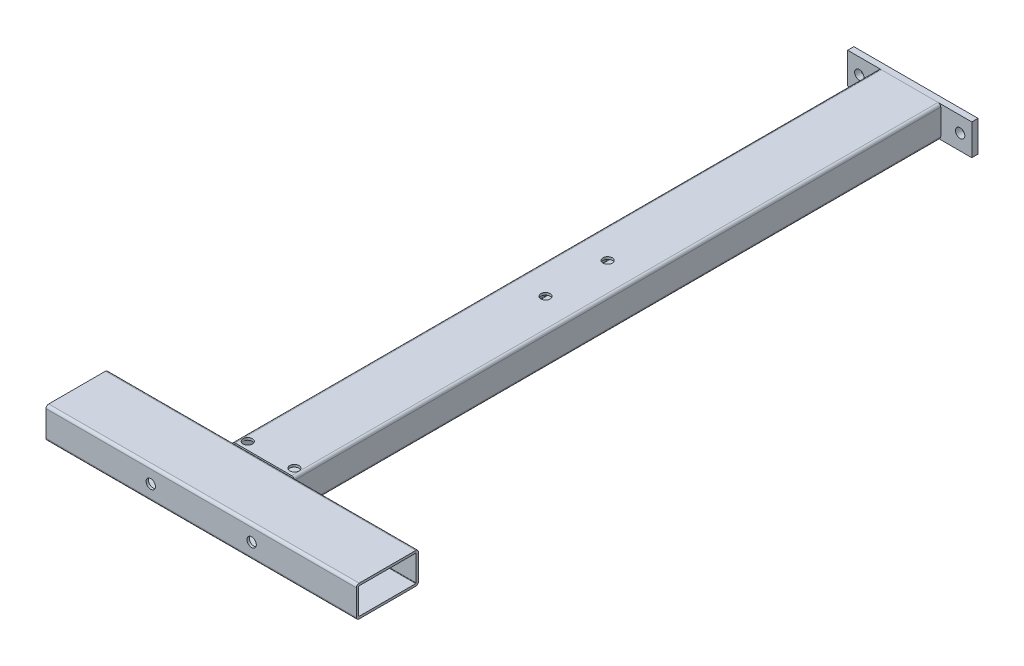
ISO-10303-21;
HEADER;
FILE_DESCRIPTION(('STEP AP214'),'2;1');
FILE_NAME('part.step','',(''),(''),'','','');
FILE_SCHEMA(('AUTOMOTIVE_DESIGN { 1 0 10303 214 1 1 1 1 }'));
ENDSEC;
DATA;
#1=APPLICATION_CONTEXT('core data for automotive mechanical design processes');
#2=APPLICATION_PROTOCOL_DEFINITION('international standard','automotive_design',2000,#1);
#3=PRODUCT_CONTEXT('',#1,'mechanical');
#4=PRODUCT('Part','Part','',(#3));
#5=PRODUCT_RELATED_PRODUCT_CATEGORY('part','',(#4));
#6=PRODUCT_DEFINITION_FORMATION('','',#4);
#7=PRODUCT_DEFINITION_CONTEXT('part definition',#1,'design');
#8=PRODUCT_DEFINITION('design','',#6,#7);
#9=PRODUCT_DEFINITION_SHAPE('','',#8);
#10=(LENGTH_UNIT() NAMED_UNIT(*) SI_UNIT(.MILLI.,.METRE.));
#11=(NAMED_UNIT(*) PLANE_ANGLE_UNIT() SI_UNIT($,.RADIAN.));
#12=(NAMED_UNIT(*) SI_UNIT($,.STERADIAN.) SOLID_ANGLE_UNIT());
#13=UNCERTAINTY_MEASURE_WITH_UNIT(LENGTH_MEASURE(1.E-05),#10,'distance_accuracy_value','');
#14=(GEOMETRIC_REPRESENTATION_CONTEXT(3) GLOBAL_UNCERTAINTY_ASSIGNED_CONTEXT((#13)) GLOBAL_UNIT_ASSIGNED_CONTEXT((#10,
#11,#12)) REPRESENTATION_CONTEXT('',''));
#15=CARTESIAN_POINT('',(0.,0.,0.));
#16=DIRECTION('',(0.,0.,1.));
#17=DIRECTION('',(1.,0.,0.));
#18=AXIS2_PLACEMENT_3D('',#15,#16,#17);
#19=CARTESIAN_POINT('',(-80.,20.,-881.));
#20=DIRECTION('',(1.,0.,0.));
#21=DIRECTION('',(0.,1.,0.));
#22=AXIS2_PLACEMENT_3D('',#19,#20,#21);
#23=PLANE('',#22);
#24=DIRECTION('',(0.,1.,0.));
#25=VECTOR('',#24,1.);
#26=CARTESIAN_POINT('',(-80.,20.,-873.));
#27=LINE('',#26,#25);
#28=CARTESIAN_POINT('',(-80.,-20.,-873.));
#29=VERTEX_POINT('',#28);
#30=CARTESIAN_POINT('',(-80.,20.,-873.));
#31=VERTEX_POINT('',#30);
#32=EDGE_CURVE('E135',#29,#31,#27,.T.);
#33=ORIENTED_EDGE('',*,*,#32,.T.);
#34=DIRECTION('',(0.,0.,1.));
#35=VECTOR('',#34,1.);
#36=CARTESIAN_POINT('',(-80.,20.,-881.));
#37=LINE('',#36,#35);
#38=CARTESIAN_POINT('',(-80.,20.,-881.));
#39=VERTEX_POINT('',#38);
#40=EDGE_CURVE('E13',#39,#31,#37,.T.);
#41=ORIENTED_EDGE('',*,*,#40,.F.);
#42=DIRECTION('',(0.,1.,0.));
#43=VECTOR('',#42,1.);
#44=CARTESIAN_POINT('',(-80.,20.,-881.));
#45=LINE('',#44,#43);
#46=CARTESIAN_POINT('',(-80.,-20.,-881.));
#47=VERTEX_POINT('',#46);
#48=EDGE_CURVE('E122',#47,#39,#45,.T.);
#49=ORIENTED_EDGE('',*,*,#48,.F.);
#50=DIRECTION('',(0.,0.,1.));
#51=VECTOR('',#50,1.);
#52=CARTESIAN_POINT('',(-80.,-20.,-881.));
#53=LINE('',#52,#51);
#54=EDGE_CURVE('E131',#47,#29,#53,.T.);
#55=ORIENTED_EDGE('',*,*,#54,.T.);
#56=EDGE_LOOP('',(#33,#41,#49,#55));
#57=FACE_BOUND('',#56,.T.);
#58=ADVANCED_FACE('F69',(#57),#23,.F.);
#59=CARTESIAN_POINT('',(-80.,20.,-881.));
#60=DIRECTION('',(0.,-1.,0.));
#61=DIRECTION('',(0.,0.,-1.));
#62=AXIS2_PLACEMENT_3D('',#59,#60,#61);
#63=PLANE('',#62);
#64=DIRECTION('',(1.,0.,0.));
#65=VECTOR('',#64,1.);
#66=CARTESIAN_POINT('',(-80.,20.,-873.));
#67=LINE('',#66,#65);
#68=CARTESIAN_POINT('',(80.,20.,-873.));
#69=VERTEX_POINT('',#68);
#70=EDGE_CURVE('E126',#31,#69,#67,.T.);
#71=ORIENTED_EDGE('',*,*,#70,.T.);
#72=DIRECTION('',(0.,0.,1.));
#73=VECTOR('',#72,1.);
#74=CARTESIAN_POINT('',(80.,20.,-881.));
#75=LINE('',#74,#73);
#76=CARTESIAN_POINT('',(80.,20.,-881.));
#77=VERTEX_POINT('',#76);
#78=EDGE_CURVE('E78',#77,#69,#75,.T.);
#79=ORIENTED_EDGE('',*,*,#78,.F.);
#80=DIRECTION('',(1.,0.,0.));
#81=VECTOR('',#80,1.);
#82=CARTESIAN_POINT('',(-80.,20.,-881.));
#83=LINE('',#82,#81);
#84=EDGE_CURVE('E117',#39,#77,#83,.T.);
#85=ORIENTED_EDGE('',*,*,#84,.F.);
#86=ORIENTED_EDGE('',*,*,#40,.T.);
#87=EDGE_LOOP('',(#71,#79,#85,#86));
#88=FACE_BOUND('',#87,.T.);
#89=ADVANCED_FACE('F125',(#88),#63,.F.);
#90=CARTESIAN_POINT('',(80.,20.,-881.));
#91=DIRECTION('',(-1.,0.,0.));
#92=DIRECTION('',(0.,-1.,0.));
#93=AXIS2_PLACEMENT_3D('',#90,#91,#92);
#94=PLANE('',#93);
#95=DIRECTION('',(0.,-1.,0.));
#96=VECTOR('',#95,1.);
#97=CARTESIAN_POINT('',(80.,20.,-873.));
#98=LINE('',#97,#96);
#99=CARTESIAN_POINT('',(80.,-20.,-873.));
#100=VERTEX_POINT('',#99);
#101=EDGE_CURVE('E104',#69,#100,#98,.T.);
#102=ORIENTED_EDGE('',*,*,#101,.T.);
#103=DIRECTION('',(0.,0.,1.));
#104=VECTOR('',#103,1.);
#105=CARTESIAN_POINT('',(80.,-20.,-881.));
#106=LINE('',#105,#104);
#107=CARTESIAN_POINT('',(80.,-20.,-881.));
#108=VERTEX_POINT('',#107);
#109=EDGE_CURVE('E127',#108,#100,#106,.T.);
#110=ORIENTED_EDGE('',*,*,#109,.F.);
#111=DIRECTION('',(0.,-1.,0.));
#112=VECTOR('',#111,1.);
#113=CARTESIAN_POINT('',(80.,20.,-881.));
#114=LINE('',#113,#112);
#115=EDGE_CURVE('E120',#77,#108,#114,.T.);
#116=ORIENTED_EDGE('',*,*,#115,.F.);
#117=ORIENTED_EDGE('',*,*,#78,.T.);
#118=EDGE_LOOP('',(#102,#110,#116,#117));
#119=FACE_BOUND('',#118,.T.);
#120=ADVANCED_FACE('F129',(#119),#94,.F.);
#121=CARTESIAN_POINT('',(-80.,-20.,-881.));
#122=DIRECTION('',(0.,1.,0.));
#123=DIRECTION('',(0.,0.,1.));
#124=AXIS2_PLACEMENT_3D('',#121,#122,#123);
#125=PLANE('',#124);
#126=DIRECTION('',(-1.,0.,0.));
#127=VECTOR('',#126,1.);
#128=CARTESIAN_POINT('',(-80.,-20.,-873.));
#129=LINE('',#128,#127);
#130=EDGE_CURVE('E110',#100,#29,#129,.T.);
#131=ORIENTED_EDGE('',*,*,#130,.T.);
#132=ORIENTED_EDGE('',*,*,#54,.F.);
#133=DIRECTION('',(-1.,0.,0.));
#134=VECTOR('',#133,1.);
#135=CARTESIAN_POINT('',(-80.,-20.,-881.));
#136=LINE('',#135,#134);
#137=EDGE_CURVE('E87',#108,#47,#136,.T.);
#138=ORIENTED_EDGE('',*,*,#137,.F.);
#139=ORIENTED_EDGE('',*,*,#109,.T.);
#140=EDGE_LOOP('',(#131,#132,#138,#139));
#141=FACE_BOUND('',#140,.T.);
#142=ADVANCED_FACE('F179',(#141),#125,.F.);
#143=CARTESIAN_POINT('',(-80.,-20.,-881.));
#144=DIRECTION('',(0.,0.,1.));
#145=DIRECTION('',(1.,0.,0.));
#146=AXIS2_PLACEMENT_3D('',#143,#144,#145);
#147=PLANE('',#146);
#148=CARTESIAN_POINT('',(-65.,0.,-881.));
#149=DIRECTION('',(0.,0.,1.));
#150=DIRECTION('',(1.,0.,0.));
#151=AXIS2_PLACEMENT_3D('',#148,#149,#150);
#152=CIRCLE('',#151,6.);
#153=CARTESIAN_POINT('',(-59.,0.,-881.));
#154=VERTEX_POINT('',#153);
#155=EDGE_CURVE('E144',#154,#154,#152,.T.);
#156=ORIENTED_EDGE('',*,*,#155,.T.);
#157=EDGE_LOOP('',(#156));
#158=FACE_BOUND('',#157,.T.);
#159=CARTESIAN_POINT('',(65.,0.,-881.));
#160=DIRECTION('',(0.,0.,1.));
#161=DIRECTION('',(1.,0.,0.));
#162=AXIS2_PLACEMENT_3D('',#159,#160,#161);
#163=CIRCLE('',#162,6.);
#164=CARTESIAN_POINT('',(71.,0.,-881.));
#165=VERTEX_POINT('',#164);
#166=EDGE_CURVE('E149',#165,#165,#163,.T.);
#167=ORIENTED_EDGE('',*,*,#166,.T.);
#168=EDGE_LOOP('',(#167));
#169=FACE_BOUND('',#168,.T.);
#170=ORIENTED_EDGE('',*,*,#48,.T.);
#171=ORIENTED_EDGE('',*,*,#84,.T.);
#172=ORIENTED_EDGE('',*,*,#115,.T.);
#173=ORIENTED_EDGE('',*,*,#137,.T.);
#174=EDGE_LOOP('',(#170,#171,#172,#173));
#175=FACE_BOUND('',#174,.T.);
#176=ADVANCED_FACE('F118',(#158,#169,#175),#147,.F.);
#177=CARTESIAN_POINT('',(-80.,-20.,-873.));
#178=DIRECTION('',(0.,0.,1.));
#179=DIRECTION('',(1.,0.,0.));
#180=AXIS2_PLACEMENT_3D('',#177,#178,#179);
#181=PLANE('',#180);
#182=CARTESIAN_POINT('',(-65.,0.,-873.));
#183=DIRECTION('',(0.,0.,1.));
#184=DIRECTION('',(1.,0.,0.));
#185=AXIS2_PLACEMENT_3D('',#182,#183,#184);
#186=CIRCLE('',#185,6.);
#187=CARTESIAN_POINT('',(-59.,0.,-873.));
#188=VERTEX_POINT('',#187);
#189=EDGE_CURVE('E72',#188,#188,#186,.T.);
#190=ORIENTED_EDGE('',*,*,#189,.F.);
#191=EDGE_LOOP('',(#190));
#192=FACE_BOUND('',#191,.T.);
#193=CARTESIAN_POINT('',(65.,0.,-873.));
#194=DIRECTION('',(0.,0.,1.));
#195=DIRECTION('',(1.,0.,0.));
#196=AXIS2_PLACEMENT_3D('',#193,#194,#195);
#197=CIRCLE('',#196,6.);
#198=CARTESIAN_POINT('',(71.,0.,-873.));
#199=VERTEX_POINT('',#198);
#200=EDGE_CURVE('E142',#199,#199,#197,.T.);
#201=ORIENTED_EDGE('',*,*,#200,.F.);
#202=EDGE_LOOP('',(#201));
#203=FACE_BOUND('',#202,.T.);
#204=ORIENTED_EDGE('',*,*,#32,.F.);
#205=ORIENTED_EDGE('',*,*,#130,.F.);
#206=ORIENTED_EDGE('',*,*,#101,.F.);
#207=ORIENTED_EDGE('',*,*,#70,.F.);
#208=EDGE_LOOP('',(#204,#205,#206,#207));
#209=FACE_BOUND('',#208,.T.);
#210=ADVANCED_FACE('F161',(#192,#203,#209),#181,.T.);
#211=CARTESIAN_POINT('',(65.,0.,-881.));
#212=DIRECTION('',(0.,0.,1.));
#213=DIRECTION('',(1.,0.,0.));
#214=AXIS2_PLACEMENT_3D('',#211,#212,#213);
#215=CYLINDRICAL_SURFACE('',#214,6.);
#216=ORIENTED_EDGE('',*,*,#200,.T.);
#217=EDGE_LOOP('',(#216));
#218=FACE_BOUND('',#217,.T.);
#219=ORIENTED_EDGE('',*,*,#166,.F.);
#220=EDGE_LOOP('',(#219));
#221=FACE_BOUND('',#220,.T.);
#222=ADVANCED_FACE('F158',(#218,#221),#215,.F.);
#223=CARTESIAN_POINT('',(-65.,0.,-881.));
#224=DIRECTION('',(0.,0.,1.));
#225=DIRECTION('',(1.,0.,0.));
#226=AXIS2_PLACEMENT_3D('',#223,#224,#225);
#227=CYLINDRICAL_SURFACE('',#226,6.);
#228=ORIENTED_EDGE('',*,*,#189,.T.);
#229=EDGE_LOOP('',(#228));
#230=FACE_BOUND('',#229,.T.);
#231=ORIENTED_EDGE('',*,*,#155,.F.);
#232=EDGE_LOOP('',(#231));
#233=FACE_BOUND('',#232,.T.);
#234=ADVANCED_FACE('F160',(#230,#233),#227,.F.);
#235=CLOSED_SHELL('',(#58,#89,#120,#142,#176,#210,#222,#234));
#236=MANIFOLD_SOLID_BREP('B2',#235);
#237=CARTESIAN_POINT('',(36.5,-16.5,-873.));
#238=DIRECTION('',(0.,0.,1.));
#239=DIRECTION('',(1.,0.,0.));
#240=AXIS2_PLACEMENT_3D('',#237,#238,#239);
#241=CYLINDRICAL_SURFACE('',#240,3.5);
#242=CARTESIAN_POINT('',(36.5,-16.5,-40.));
#243=DIRECTION('',(0.,0.,1.));
#244=DIRECTION('',(1.,0.,0.));
#245=AXIS2_PLACEMENT_3D('',#242,#243,#244);
#246=CIRCLE('',#245,3.5);
#247=CARTESIAN_POINT('',(36.5,-20.,-40.));
#248=VERTEX_POINT('',#247);
#249=CARTESIAN_POINT('',(40.,-16.5,-40.0000000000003));
#250=VERTEX_POINT('',#249);
#251=EDGE_CURVE('E411',#248,#250,#246,.T.);
#252=ORIENTED_EDGE('',*,*,#251,.F.);
#253=DIRECTION('',(0.,0.,1.));
#254=VECTOR('',#253,1.);
#255=CARTESIAN_POINT('',(36.5,-20.,-873.));
#256=LINE('',#255,#254);
#257=CARTESIAN_POINT('',(36.5,-20.,-873.));
#258=VERTEX_POINT('',#257);
#259=EDGE_CURVE('E470',#258,#248,#256,.T.);
#260=ORIENTED_EDGE('',*,*,#259,.F.);
#261=CARTESIAN_POINT('',(36.5,-16.5,-873.));
#262=DIRECTION('',(0.,0.,-1.));
#263=DIRECTION('',(1.,0.,0.));
#264=AXIS2_PLACEMENT_3D('',#261,#262,#263);
#265=CIRCLE('',#264,3.5);
#266=CARTESIAN_POINT('',(40.,-16.5,-873.));
#267=VERTEX_POINT('',#266);
#268=EDGE_CURVE('E339',#267,#258,#265,.T.);
#269=ORIENTED_EDGE('',*,*,#268,.F.);
#270=DIRECTION('',(0.,0.,1.));
#271=VECTOR('',#270,1.);
#272=CARTESIAN_POINT('',(40.,-16.5,-873.));
#273=LINE('',#272,#271);
#274=EDGE_CURVE('E341',#267,#250,#273,.T.);
#275=ORIENTED_EDGE('',*,*,#274,.T.);
#276=EDGE_LOOP('',(#252,#260,#269,#275));
#277=FACE_BOUND('',#276,.T.);
#278=ADVANCED_FACE('F243',(#277),#241,.T.);
#279=CARTESIAN_POINT('',(36.5,-20.,-873.));
#280=DIRECTION('',(0.,1.,0.));
#281=DIRECTION('',(0.,0.,1.));
#282=AXIS2_PLACEMENT_3D('',#279,#280,#281);
#283=PLANE('',#282);
#284=CARTESIAN_POINT('',(0.,-20.,-403.77));
#285=DIRECTION('',(0.,1.,0.));
#286=DIRECTION('',(0.,0.,1.));
#287=AXIS2_PLACEMENT_3D('',#284,#285,#286);
#288=CIRCLE('',#287,6.00000000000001);
#289=CARTESIAN_POINT('',(0.,-20.,-397.77));
#290=VERTEX_POINT('',#289);
#291=EDGE_CURVE('E819',#290,#290,#288,.T.);
#292=ORIENTED_EDGE('',*,*,#291,.T.);
#293=EDGE_LOOP('',(#292));
#294=FACE_BOUND('',#293,.T.);
#295=CARTESIAN_POINT('',(0.,-20.,-483.77));
#296=DIRECTION('',(0.,1.,0.));
#297=DIRECTION('',(0.,0.,1.));
#298=AXIS2_PLACEMENT_3D('',#295,#296,#297);
#299=CIRCLE('',#298,6.00000000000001);
#300=CARTESIAN_POINT('',(0.,-20.,-477.77));
#301=VERTEX_POINT('',#300);
#302=EDGE_CURVE('E383',#301,#301,#299,.T.);
#303=ORIENTED_EDGE('',*,*,#302,.T.);
#304=EDGE_LOOP('',(#303));
#305=FACE_BOUND('',#304,.T.);
#306=DIRECTION('',(-1.,0.,0.));
#307=VECTOR('',#306,1.);
#308=CARTESIAN_POINT('',(200.,-20.,-40.));
#309=LINE('',#308,#307);
#310=CARTESIAN_POINT('',(-36.5,-20.,-40.));
#311=VERTEX_POINT('',#310);
#312=EDGE_CURVE('E344',#248,#311,#309,.T.);
#313=ORIENTED_EDGE('',*,*,#312,.T.);
#314=DIRECTION('',(0.,0.,1.));
#315=VECTOR('',#314,1.);
#316=CARTESIAN_POINT('',(-36.5,-20.,-873.));
#317=LINE('',#316,#315);
#318=CARTESIAN_POINT('',(-36.5,-20.,-873.));
#319=VERTEX_POINT('',#318);
#320=EDGE_CURVE('E474',#319,#311,#317,.T.);
#321=ORIENTED_EDGE('',*,*,#320,.F.);
#322=DIRECTION('',(-1.,0.,0.));
#323=VECTOR('',#322,1.);
#324=CARTESIAN_POINT('',(36.5,-20.,-873.));
#325=LINE('',#324,#323);
#326=EDGE_CURVE('E429',#258,#319,#325,.T.);
#327=ORIENTED_EDGE('',*,*,#326,.F.);
#328=ORIENTED_EDGE('',*,*,#259,.T.);
#329=EDGE_LOOP('',(#313,#321,#327,#328));
#330=FACE_BOUND('',#329,.T.);
#331=ADVANCED_FACE('F548',(#294,#305,#330),#283,.F.);
#332=CARTESIAN_POINT('',(-36.5,-16.5,-873.));
#333=DIRECTION('',(0.,0.,1.));
#334=DIRECTION('',(1.,0.,0.));
#335=AXIS2_PLACEMENT_3D('',#332,#333,#334);
#336=CYLINDRICAL_SURFACE('',#335,3.5);
#337=CARTESIAN_POINT('',(-36.5,-16.5,-40.));
#338=DIRECTION('',(0.,0.,1.));
#339=DIRECTION('',(1.,0.,0.));
#340=AXIS2_PLACEMENT_3D('',#337,#338,#339);
#341=CIRCLE('',#340,3.5);
#342=CARTESIAN_POINT('',(-40.,-16.5,-40.));
#343=VERTEX_POINT('',#342);
#344=EDGE_CURVE('E415',#343,#311,#341,.T.);
#345=ORIENTED_EDGE('',*,*,#344,.F.);
#346=DIRECTION('',(0.,0.,1.));
#347=VECTOR('',#346,1.);
#348=CARTESIAN_POINT('',(-40.,-16.5,-873.));
#349=LINE('',#348,#347);
#350=CARTESIAN_POINT('',(-40.,-16.5,-873.));
#351=VERTEX_POINT('',#350);
#352=EDGE_CURVE('E477',#351,#343,#349,.T.);
#353=ORIENTED_EDGE('',*,*,#352,.F.);
#354=CARTESIAN_POINT('',(-36.5,-16.5,-873.));
#355=DIRECTION('',(0.,0.,-1.));
#356=DIRECTION('',(1.,0.,0.));
#357=AXIS2_PLACEMENT_3D('',#354,#355,#356);
#358=CIRCLE('',#357,3.5);
#359=EDGE_CURVE('E426',#319,#351,#358,.T.);
#360=ORIENTED_EDGE('',*,*,#359,.F.);
#361=ORIENTED_EDGE('',*,*,#320,.T.);
#362=EDGE_LOOP('',(#345,#353,#360,#361));
#363=FACE_BOUND('',#362,.T.);
#364=ADVANCED_FACE('F553',(#363),#336,.T.);
#365=CARTESIAN_POINT('',(-40.,16.5,-873.));
#366=DIRECTION('',(1.,0.,0.));
#367=DIRECTION('',(0.,0.,-1.));
#368=AXIS2_PLACEMENT_3D('',#365,#366,#367);
#369=PLANE('',#368);
#370=DIRECTION('',(0.,-1.,0.));
#371=VECTOR('',#370,1.);
#372=CARTESIAN_POINT('',(-40.,16.5,-40.));
#373=LINE('',#372,#371);
#374=CARTESIAN_POINT('',(-40.,16.5,-40.));
#375=VERTEX_POINT('',#374);
#376=EDGE_CURVE('E67',#375,#343,#373,.T.);
#377=ORIENTED_EDGE('',*,*,#376,.F.);
#378=DIRECTION('',(0.,0.,1.));
#379=VECTOR('',#378,1.);
#380=CARTESIAN_POINT('',(-40.,16.5,-873.));
#381=LINE('',#380,#379);
#382=CARTESIAN_POINT('',(-40.,16.5,-873.));
#383=VERTEX_POINT('',#382);
#384=EDGE_CURVE('E333',#383,#375,#381,.T.);
#385=ORIENTED_EDGE('',*,*,#384,.F.);
#386=DIRECTION('',(0.,1.,0.));
#387=VECTOR('',#386,1.);
#388=CARTESIAN_POINT('',(-40.,16.5,-873.));
#389=LINE('',#388,#387);
#390=EDGE_CURVE('E423',#351,#383,#389,.T.);
#391=ORIENTED_EDGE('',*,*,#390,.F.);
#392=ORIENTED_EDGE('',*,*,#352,.T.);
#393=EDGE_LOOP('',(#377,#385,#391,#392));
#394=FACE_BOUND('',#393,.T.);
#395=ADVANCED_FACE('F487',(#394),#369,.F.);
#396=CARTESIAN_POINT('',(-36.5,16.5,-873.));
#397=DIRECTION('',(0.,0.,1.));
#398=DIRECTION('',(1.,0.,0.));
#399=AXIS2_PLACEMENT_3D('',#396,#397,#398);
#400=CYLINDRICAL_SURFACE('',#399,3.5);
#401=CARTESIAN_POINT('',(-36.5,16.5,-40.));
#402=DIRECTION('',(0.,0.,1.));
#403=DIRECTION('',(1.,0.,0.));
#404=AXIS2_PLACEMENT_3D('',#401,#402,#403);
#405=CIRCLE('',#404,3.5);
#406=CARTESIAN_POINT('',(-36.5,20.,-40.));
#407=VERTEX_POINT('',#406);
#408=EDGE_CURVE('E252',#407,#375,#405,.T.);
#409=ORIENTED_EDGE('',*,*,#408,.F.);
#410=DIRECTION('',(0.,0.,1.));
#411=VECTOR('',#410,1.);
#412=CARTESIAN_POINT('',(-36.5,20.,-873.));
#413=LINE('',#412,#411);
#414=CARTESIAN_POINT('',(-36.5,20.,-873.));
#415=VERTEX_POINT('',#414);
#416=EDGE_CURVE('E323',#415,#407,#413,.T.);
#417=ORIENTED_EDGE('',*,*,#416,.F.);
#418=CARTESIAN_POINT('',(-36.5,16.5,-873.));
#419=DIRECTION('',(0.,0.,-1.));
#420=DIRECTION('',(1.,0.,0.));
#421=AXIS2_PLACEMENT_3D('',#418,#419,#420);
#422=CIRCLE('',#421,3.5);
#423=EDGE_CURVE('E420',#383,#415,#422,.T.);
#424=ORIENTED_EDGE('',*,*,#423,.F.);
#425=ORIENTED_EDGE('',*,*,#384,.T.);
#426=EDGE_LOOP('',(#409,#417,#424,#425));
#427=FACE_BOUND('',#426,.T.);
#428=ADVANCED_FACE('F483',(#427),#400,.T.);
#429=CARTESIAN_POINT('',(-36.5,20.,-873.));
#430=DIRECTION('',(0.,-1.,0.));
#431=DIRECTION('',(0.,0.,-1.));
#432=AXIS2_PLACEMENT_3D('',#429,#430,#431);
#433=PLANE('',#432);
#434=CARTESIAN_POINT('',(0.,20.,-403.77));
#435=DIRECTION('',(0.,1.,0.));
#436=DIRECTION('',(0.,0.,1.));
#437=AXIS2_PLACEMENT_3D('',#434,#435,#436);
#438=CIRCLE('',#437,6.00000000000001);
#439=CARTESIAN_POINT('',(0.,20.,-397.77));
#440=VERTEX_POINT('',#439);
#441=EDGE_CURVE('E820',#440,#440,#438,.T.);
#442=ORIENTED_EDGE('',*,*,#441,.F.);
#443=EDGE_LOOP('',(#442));
#444=FACE_BOUND('',#443,.T.);
#445=CARTESIAN_POINT('',(0.,20.,-483.77));
#446=DIRECTION('',(0.,1.,0.));
#447=DIRECTION('',(0.,0.,1.));
#448=AXIS2_PLACEMENT_3D('',#445,#446,#447);
#449=CIRCLE('',#448,6.00000000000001);
#450=CARTESIAN_POINT('',(0.,20.,-477.77));
#451=VERTEX_POINT('',#450);
#452=EDGE_CURVE('E390',#451,#451,#449,.T.);
#453=ORIENTED_EDGE('',*,*,#452,.F.);
#454=EDGE_LOOP('',(#453));
#455=FACE_BOUND('',#454,.T.);
#456=CARTESIAN_POINT('',(-30.,20.,-50.));
#457=DIRECTION('',(0.,1.,0.));
#458=DIRECTION('',(0.,0.,1.));
#459=AXIS2_PLACEMENT_3D('',#456,#457,#458);
#460=CIRCLE('',#459,6.);
#461=CARTESIAN_POINT('',(-30.,20.,-44.));
#462=VERTEX_POINT('',#461);
#463=EDGE_CURVE('E400',#462,#462,#460,.T.);
#464=ORIENTED_EDGE('',*,*,#463,.F.);
#465=EDGE_LOOP('',(#464));
#466=FACE_BOUND('',#465,.T.);
#467=CARTESIAN_POINT('',(30.,20.,-50.));
#468=DIRECTION('',(0.,1.,0.));
#469=DIRECTION('',(0.,0.,1.));
#470=AXIS2_PLACEMENT_3D('',#467,#468,#469);
#471=CIRCLE('',#470,6.);
#472=CARTESIAN_POINT('',(30.,20.,-44.));
#473=VERTEX_POINT('',#472);
#474=EDGE_CURVE('E345',#473,#473,#471,.T.);
#475=ORIENTED_EDGE('',*,*,#474,.F.);
#476=EDGE_LOOP('',(#475));
#477=FACE_BOUND('',#476,.T.);
#478=DIRECTION('',(-1.,0.,0.));
#479=VECTOR('',#478,1.);
#480=CARTESIAN_POINT('',(200.,20.,-40.));
#481=LINE('',#480,#479);
#482=CARTESIAN_POINT('',(36.5,20.,-40.));
#483=VERTEX_POINT('',#482);
#484=EDGE_CURVE('E301',#483,#407,#481,.T.);
#485=ORIENTED_EDGE('',*,*,#484,.F.);
#486=DIRECTION('',(0.,0.,1.));
#487=VECTOR('',#486,1.);
#488=CARTESIAN_POINT('',(36.5,20.,-873.));
#489=LINE('',#488,#487);
#490=CARTESIAN_POINT('',(36.5,20.,-873.));
#491=VERTEX_POINT('',#490);
#492=EDGE_CURVE('E320',#491,#483,#489,.T.);
#493=ORIENTED_EDGE('',*,*,#492,.F.);
#494=DIRECTION('',(1.,0.,0.));
#495=VECTOR('',#494,1.);
#496=CARTESIAN_POINT('',(-36.5,20.,-873.));
#497=LINE('',#496,#495);
#498=EDGE_CURVE('E417',#415,#491,#497,.T.);
#499=ORIENTED_EDGE('',*,*,#498,.F.);
#500=ORIENTED_EDGE('',*,*,#416,.T.);
#501=EDGE_LOOP('',(#485,#493,#499,#500));
#502=FACE_BOUND('',#501,.T.);
#503=ADVANCED_FACE('F317',(#444,#455,#466,#477,#502),#433,.F.);
#504=CARTESIAN_POINT('',(36.5,16.5,-873.));
#505=DIRECTION('',(0.,0.,1.));
#506=DIRECTION('',(1.,0.,0.));
#507=AXIS2_PLACEMENT_3D('',#504,#505,#506);
#508=CYLINDRICAL_SURFACE('',#507,3.5);
#509=CARTESIAN_POINT('',(36.5,16.5,-40.));
#510=DIRECTION('',(0.,0.,1.));
#511=DIRECTION('',(1.,0.,0.));
#512=AXIS2_PLACEMENT_3D('',#509,#510,#511);
#513=CIRCLE('',#512,3.5);
#514=CARTESIAN_POINT('',(40.,16.5,-40.));
#515=VERTEX_POINT('',#514);
#516=EDGE_CURVE('E304',#515,#483,#513,.T.);
#517=ORIENTED_EDGE('',*,*,#516,.F.);
#518=DIRECTION('',(0.,0.,1.));
#519=VECTOR('',#518,1.);
#520=CARTESIAN_POINT('',(40.,16.5,-873.));
#521=LINE('',#520,#519);
#522=CARTESIAN_POINT('',(40.,16.5,-873.));
#523=VERTEX_POINT('',#522);
#524=EDGE_CURVE('E337',#523,#515,#521,.T.);
#525=ORIENTED_EDGE('',*,*,#524,.F.);
#526=CARTESIAN_POINT('',(36.5,16.5,-873.));
#527=DIRECTION('',(0.,0.,-1.));
#528=DIRECTION('',(1.,0.,0.));
#529=AXIS2_PLACEMENT_3D('',#526,#527,#528);
#530=CIRCLE('',#529,3.5);
#531=EDGE_CURVE('E327',#491,#523,#530,.T.);
#532=ORIENTED_EDGE('',*,*,#531,.F.);
#533=ORIENTED_EDGE('',*,*,#492,.T.);
#534=EDGE_LOOP('',(#517,#525,#532,#533));
#535=FACE_BOUND('',#534,.T.);
#536=ADVANCED_FACE('F325',(#535),#508,.T.);
#537=CARTESIAN_POINT('',(-36.5,-16.5,-873.));
#538=DIRECTION('',(0.,0.,1.));
#539=DIRECTION('',(1.,0.,0.));
#540=AXIS2_PLACEMENT_3D('',#537,#538,#539);
#541=CYLINDRICAL_SURFACE('',#540,0.499999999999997);
#542=DIRECTION('',(0.,0.,1.));
#543=VECTOR('',#542,1.);
#544=CARTESIAN_POINT('',(-37.,-16.5,-873.));
#545=LINE('',#544,#543);
#546=CARTESIAN_POINT('',(-37.,-16.5,-873.));
#547=VERTEX_POINT('',#546);
#548=CARTESIAN_POINT('',(-37.,-16.5,-40.0000000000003));
#549=VERTEX_POINT('',#548);
#550=EDGE_CURVE('E328',#547,#549,#545,.T.);
#551=ORIENTED_EDGE('',*,*,#550,.T.);
#552=CARTESIAN_POINT('',(-36.5,-16.5,-40.));
#553=DIRECTION('',(0.,0.,1.));
#554=DIRECTION('',(1.,0.,0.));
#555=AXIS2_PLACEMENT_3D('',#552,#553,#554);
#556=CIRCLE('',#555,0.499999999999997);
#557=CARTESIAN_POINT('',(-36.5,-17.,-40.));
#558=VERTEX_POINT('',#557);
#559=EDGE_CURVE('E331',#549,#558,#556,.T.);
#560=ORIENTED_EDGE('',*,*,#559,.T.);
#561=DIRECTION('',(0.,0.,1.));
#562=VECTOR('',#561,1.);
#563=CARTESIAN_POINT('',(-36.5,-17.,-873.));
#564=LINE('',#563,#562);
#565=CARTESIAN_POINT('',(-36.5,-17.,-873.));
#566=VERTEX_POINT('',#565);
#567=EDGE_CURVE('E346',#566,#558,#564,.T.);
#568=ORIENTED_EDGE('',*,*,#567,.F.);
#569=CARTESIAN_POINT('',(-36.5,-16.5,-873.));
#570=DIRECTION('',(0.,0.,-1.));
#571=DIRECTION('',(1.,0.,0.));
#572=AXIS2_PLACEMENT_3D('',#569,#570,#571);
#573=CIRCLE('',#572,0.499999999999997);
#574=EDGE_CURVE('E350',#566,#547,#573,.T.);
#575=ORIENTED_EDGE('',*,*,#574,.T.);
#576=EDGE_LOOP('',(#551,#560,#568,#575));
#577=FACE_BOUND('',#576,.T.);
#578=ADVANCED_FACE('F525',(#577),#541,.F.);
#579=CARTESIAN_POINT('',(36.5,-17.,-873.));
#580=DIRECTION('',(0.,1.,0.));
#581=DIRECTION('',(0.,0.,1.));
#582=AXIS2_PLACEMENT_3D('',#579,#580,#581);
#583=PLANE('',#582);
#584=CARTESIAN_POINT('',(0.,-17.,-403.77));
#585=DIRECTION('',(0.,1.,0.));
#586=DIRECTION('',(0.,0.,1.));
#587=AXIS2_PLACEMENT_3D('',#584,#585,#586);
#588=CIRCLE('',#587,6.00000000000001);
#589=CARTESIAN_POINT('',(0.,-17.,-397.77));
#590=VERTEX_POINT('',#589);
#591=EDGE_CURVE('E395',#590,#590,#588,.T.);
#592=ORIENTED_EDGE('',*,*,#591,.F.);
#593=EDGE_LOOP('',(#592));
#594=FACE_BOUND('',#593,.T.);
#595=CARTESIAN_POINT('',(0.,-17.,-483.77));
#596=DIRECTION('',(0.,1.,0.));
#597=DIRECTION('',(0.,0.,1.));
#598=AXIS2_PLACEMENT_3D('',#595,#596,#597);
#599=CIRCLE('',#598,6.00000000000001);
#600=CARTESIAN_POINT('',(0.,-17.,-477.77));
#601=VERTEX_POINT('',#600);
#602=EDGE_CURVE('E382',#601,#601,#599,.T.);
#603=ORIENTED_EDGE('',*,*,#602,.F.);
#604=EDGE_LOOP('',(#603));
#605=FACE_BOUND('',#604,.T.);
#606=ORIENTED_EDGE('',*,*,#567,.T.);
#607=DIRECTION('',(1.,0.,0.));
#608=VECTOR('',#607,1.);
#609=CARTESIAN_POINT('',(36.5,-17.,-40.));
#610=LINE('',#609,#608);
#611=CARTESIAN_POINT('',(36.5,-17.,-40.));
#612=VERTEX_POINT('',#611);
#613=EDGE_CURVE('E349',#558,#612,#610,.T.);
#614=ORIENTED_EDGE('',*,*,#613,.T.);
#615=DIRECTION('',(0.,0.,1.));
#616=VECTOR('',#615,1.);
#617=CARTESIAN_POINT('',(36.5,-17.,-873.));
#618=LINE('',#617,#616);
#619=CARTESIAN_POINT('',(36.5,-17.,-873.));
#620=VERTEX_POINT('',#619);
#621=EDGE_CURVE('E351',#620,#612,#618,.T.);
#622=ORIENTED_EDGE('',*,*,#621,.F.);
#623=DIRECTION('',(-1.,0.,0.));
#624=VECTOR('',#623,1.);
#625=CARTESIAN_POINT('',(36.5,-17.,-873.));
#626=LINE('',#625,#624);
#627=EDGE_CURVE('E355',#620,#566,#626,.T.);
#628=ORIENTED_EDGE('',*,*,#627,.T.);
#629=EDGE_LOOP('',(#606,#614,#622,#628));
#630=FACE_BOUND('',#629,.T.);
#631=ADVANCED_FACE('F532',(#594,#605,#630),#583,.T.);
#632=CARTESIAN_POINT('',(36.5,-16.5,-873.));
#633=DIRECTION('',(0.,0.,1.));
#634=DIRECTION('',(1.,0.,0.));
#635=AXIS2_PLACEMENT_3D('',#632,#633,#634);
#636=CYLINDRICAL_SURFACE('',#635,0.499999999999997);
#637=ORIENTED_EDGE('',*,*,#621,.T.);
#638=CARTESIAN_POINT('',(36.5,-16.5,-40.));
#639=DIRECTION('',(0.,0.,1.));
#640=DIRECTION('',(1.,0.,0.));
#641=AXIS2_PLACEMENT_3D('',#638,#639,#640);
#642=CIRCLE('',#641,0.499999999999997);
#643=CARTESIAN_POINT('',(37.,-16.5,-40.));
#644=VERTEX_POINT('',#643);
#645=EDGE_CURVE('E354',#612,#644,#642,.T.);
#646=ORIENTED_EDGE('',*,*,#645,.T.);
#647=DIRECTION('',(0.,0.,1.));
#648=VECTOR('',#647,1.);
#649=CARTESIAN_POINT('',(37.,-16.5,-873.));
#650=LINE('',#649,#648);
#651=CARTESIAN_POINT('',(37.,-16.5,-873.));
#652=VERTEX_POINT('',#651);
#653=EDGE_CURVE('E356',#652,#644,#650,.T.);
#654=ORIENTED_EDGE('',*,*,#653,.F.);
#655=CARTESIAN_POINT('',(36.5,-16.5,-873.));
#656=DIRECTION('',(0.,0.,-1.));
#657=DIRECTION('',(1.,0.,0.));
#658=AXIS2_PLACEMENT_3D('',#655,#656,#657);
#659=CIRCLE('',#658,0.499999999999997);
#660=EDGE_CURVE('E360',#652,#620,#659,.T.);
#661=ORIENTED_EDGE('',*,*,#660,.T.);
#662=EDGE_LOOP('',(#637,#646,#654,#661));
#663=FACE_BOUND('',#662,.T.);
#664=ADVANCED_FACE('F534',(#663),#636,.F.);
#665=CARTESIAN_POINT('',(37.,-16.5,-873.));
#666=DIRECTION('',(-1.,0.,0.));
#667=DIRECTION('',(0.,0.,1.));
#668=AXIS2_PLACEMENT_3D('',#665,#666,#667);
#669=PLANE('',#668);
#670=ORIENTED_EDGE('',*,*,#653,.T.);
#671=DIRECTION('',(0.,1.,0.));
#672=VECTOR('',#671,1.);
#673=CARTESIAN_POINT('',(37.,-16.5,-40.));
#674=LINE('',#673,#672);
#675=CARTESIAN_POINT('',(37.,16.5,-40.));
#676=VERTEX_POINT('',#675);
#677=EDGE_CURVE('E359',#644,#676,#674,.T.);
#678=ORIENTED_EDGE('',*,*,#677,.T.);
#679=DIRECTION('',(0.,0.,1.));
#680=VECTOR('',#679,1.);
#681=CARTESIAN_POINT('',(37.,16.5,-873.));
#682=LINE('',#681,#680);
#683=CARTESIAN_POINT('',(37.,16.5,-873.));
#684=VERTEX_POINT('',#683);
#685=EDGE_CURVE('E361',#684,#676,#682,.T.);
#686=ORIENTED_EDGE('',*,*,#685,.F.);
#687=DIRECTION('',(0.,-1.,0.));
#688=VECTOR('',#687,1.);
#689=CARTESIAN_POINT('',(37.,-16.5,-873.));
#690=LINE('',#689,#688);
#691=EDGE_CURVE('E365',#684,#652,#690,.T.);
#692=ORIENTED_EDGE('',*,*,#691,.T.);
#693=EDGE_LOOP('',(#670,#678,#686,#692));
#694=FACE_BOUND('',#693,.T.);
#695=ADVANCED_FACE('F541',(#694),#669,.T.);
#696=CARTESIAN_POINT('',(36.5,16.5,-873.));
#697=DIRECTION('',(0.,0.,1.));
#698=DIRECTION('',(1.,0.,0.));
#699=AXIS2_PLACEMENT_3D('',#696,#697,#698);
#700=CYLINDRICAL_SURFACE('',#699,0.499999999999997);
#701=ORIENTED_EDGE('',*,*,#685,.T.);
#702=CARTESIAN_POINT('',(36.5,16.5,-40.));
#703=DIRECTION('',(0.,0.,1.));
#704=DIRECTION('',(1.,0.,0.));
#705=AXIS2_PLACEMENT_3D('',#702,#703,#704);
#706=CIRCLE('',#705,0.499999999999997);
#707=CARTESIAN_POINT('',(36.5,17.,-40.));
#708=VERTEX_POINT('',#707);
#709=EDGE_CURVE('E364',#676,#708,#706,.T.);
#710=ORIENTED_EDGE('',*,*,#709,.T.);
#711=DIRECTION('',(0.,0.,1.));
#712=VECTOR('',#711,1.);
#713=CARTESIAN_POINT('',(36.5,17.,-873.));
#714=LINE('',#713,#712);
#715=CARTESIAN_POINT('',(36.5,17.,-873.));
#716=VERTEX_POINT('',#715);
#717=EDGE_CURVE('E366',#716,#708,#714,.T.);
#718=ORIENTED_EDGE('',*,*,#717,.F.);
#719=CARTESIAN_POINT('',(36.5,16.5,-873.));
#720=DIRECTION('',(0.,0.,-1.));
#721=DIRECTION('',(1.,0.,0.));
#722=AXIS2_PLACEMENT_3D('',#719,#720,#721);
#723=CIRCLE('',#722,0.499999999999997);
#724=EDGE_CURVE('E370',#716,#684,#723,.T.);
#725=ORIENTED_EDGE('',*,*,#724,.T.);
#726=EDGE_LOOP('',(#701,#710,#718,#725));
#727=FACE_BOUND('',#726,.T.);
#728=ADVANCED_FACE('F636',(#727),#700,.F.);
#729=CARTESIAN_POINT('',(-36.5,17.,-873.));
#730=DIRECTION('',(0.,-1.,0.));
#731=DIRECTION('',(0.,0.,-1.));
#732=AXIS2_PLACEMENT_3D('',#729,#730,#731);
#733=PLANE('',#732);
#734=CARTESIAN_POINT('',(0.,17.,-403.77));
#735=DIRECTION('',(0.,-1.,0.));
#736=DIRECTION('',(0.,0.,-1.));
#737=AXIS2_PLACEMENT_3D('',#734,#735,#736);
#738=CIRCLE('',#737,6.00000000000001);
#739=CARTESIAN_POINT('',(0.,17.,-409.77));
#740=VERTEX_POINT('',#739);
#741=EDGE_CURVE('E246',#740,#740,#738,.T.);
#742=ORIENTED_EDGE('',*,*,#741,.F.);
#743=EDGE_LOOP('',(#742));
#744=FACE_BOUND('',#743,.T.);
#745=CARTESIAN_POINT('',(0.,17.,-483.77));
#746=DIRECTION('',(0.,-1.,0.));
#747=DIRECTION('',(0.,0.,-1.));
#748=AXIS2_PLACEMENT_3D('',#745,#746,#747);
#749=CIRCLE('',#748,6.00000000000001);
#750=CARTESIAN_POINT('',(0.,17.,-489.77));
#751=VERTEX_POINT('',#750);
#752=EDGE_CURVE('E380',#751,#751,#749,.T.);
#753=ORIENTED_EDGE('',*,*,#752,.F.);
#754=EDGE_LOOP('',(#753));
#755=FACE_BOUND('',#754,.T.);
#756=CARTESIAN_POINT('',(-30.,17.,-50.));
#757=DIRECTION('',(0.,-1.,0.));
#758=DIRECTION('',(0.,0.,-1.));
#759=AXIS2_PLACEMENT_3D('',#756,#757,#758);
#760=CIRCLE('',#759,6.);
#761=CARTESIAN_POINT('',(-30.,17.,-56.));
#762=VERTEX_POINT('',#761);
#763=EDGE_CURVE('E387',#762,#762,#760,.F.);
#764=ORIENTED_EDGE('',*,*,#763,.T.);
#765=EDGE_LOOP('',(#764));
#766=FACE_BOUND('',#765,.T.);
#767=CARTESIAN_POINT('',(30.,17.,-50.));
#768=DIRECTION('',(0.,-1.,0.));
#769=DIRECTION('',(0.,0.,-1.));
#770=AXIS2_PLACEMENT_3D('',#767,#768,#769);
#771=CIRCLE('',#770,6.);
#772=CARTESIAN_POINT('',(30.,17.,-56.));
#773=VERTEX_POINT('',#772);
#774=EDGE_CURVE('E403',#773,#773,#771,.F.);
#775=ORIENTED_EDGE('',*,*,#774,.T.);
#776=EDGE_LOOP('',(#775));
#777=FACE_BOUND('',#776,.T.);
#778=ORIENTED_EDGE('',*,*,#717,.T.);
#779=DIRECTION('',(-1.,0.,0.));
#780=VECTOR('',#779,1.);
#781=CARTESIAN_POINT('',(-36.5,17.,-40.));
#782=LINE('',#781,#780);
#783=CARTESIAN_POINT('',(-36.5,17.,-40.));
#784=VERTEX_POINT('',#783);
#785=EDGE_CURVE('E369',#708,#784,#782,.T.);
#786=ORIENTED_EDGE('',*,*,#785,.T.);
#787=DIRECTION('',(0.,0.,1.));
#788=VECTOR('',#787,1.);
#789=CARTESIAN_POINT('',(-36.5,17.,-873.));
#790=LINE('',#789,#788);
#791=CARTESIAN_POINT('',(-36.5,17.,-873.));
#792=VERTEX_POINT('',#791);
#793=EDGE_CURVE('E371',#792,#784,#790,.T.);
#794=ORIENTED_EDGE('',*,*,#793,.F.);
#795=DIRECTION('',(1.,0.,0.));
#796=VECTOR('',#795,1.);
#797=CARTESIAN_POINT('',(-36.5,17.,-873.));
#798=LINE('',#797,#796);
#799=EDGE_CURVE('E375',#792,#716,#798,.T.);
#800=ORIENTED_EDGE('',*,*,#799,.T.);
#801=EDGE_LOOP('',(#778,#786,#794,#800));
#802=FACE_BOUND('',#801,.T.);
#803=ADVANCED_FACE('F647',(#744,#755,#766,#777,#802),#733,.T.);
#804=CARTESIAN_POINT('',(-36.5,16.5,-873.));
#805=DIRECTION('',(0.,0.,1.));
#806=DIRECTION('',(1.,0.,0.));
#807=AXIS2_PLACEMENT_3D('',#804,#805,#806);
#808=CYLINDRICAL_SURFACE('',#807,0.499999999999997);
#809=ORIENTED_EDGE('',*,*,#793,.T.);
#810=CARTESIAN_POINT('',(-36.5,16.5,-40.));
#811=DIRECTION('',(0.,0.,1.));
#812=DIRECTION('',(1.,0.,0.));
#813=AXIS2_PLACEMENT_3D('',#810,#811,#812);
#814=CIRCLE('',#813,0.499999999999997);
#815=CARTESIAN_POINT('',(-37.,16.5,-40.));
#816=VERTEX_POINT('',#815);
#817=EDGE_CURVE('E374',#784,#816,#814,.T.);
#818=ORIENTED_EDGE('',*,*,#817,.T.);
#819=DIRECTION('',(0.,0.,1.));
#820=VECTOR('',#819,1.);
#821=CARTESIAN_POINT('',(-37.,16.5,-873.));
#822=LINE('',#821,#820);
#823=CARTESIAN_POINT('',(-37.,16.5,-873.));
#824=VERTEX_POINT('',#823);
#825=EDGE_CURVE('E376',#824,#816,#822,.T.);
#826=ORIENTED_EDGE('',*,*,#825,.F.);
#827=CARTESIAN_POINT('',(-36.5,16.5,-873.));
#828=DIRECTION('',(0.,0.,-1.));
#829=DIRECTION('',(1.,0.,0.));
#830=AXIS2_PLACEMENT_3D('',#827,#828,#829);
#831=CIRCLE('',#830,0.499999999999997);
#832=EDGE_CURVE('E379',#824,#792,#831,.T.);
#833=ORIENTED_EDGE('',*,*,#832,.T.);
#834=EDGE_LOOP('',(#809,#818,#826,#833));
#835=FACE_BOUND('',#834,.T.);
#836=ADVANCED_FACE('F578',(#835),#808,.F.);
#837=CARTESIAN_POINT('',(-37.,16.5,-873.));
#838=DIRECTION('',(1.,0.,0.));
#839=DIRECTION('',(0.,0.,-1.));
#840=AXIS2_PLACEMENT_3D('',#837,#838,#839);
#841=PLANE('',#840);
#842=ORIENTED_EDGE('',*,*,#825,.T.);
#843=DIRECTION('',(0.,-1.,0.));
#844=VECTOR('',#843,1.);
#845=CARTESIAN_POINT('',(-37.,16.5,-40.));
#846=LINE('',#845,#844);
#847=EDGE_CURVE('E378',#816,#549,#846,.T.);
#848=ORIENTED_EDGE('',*,*,#847,.T.);
#849=ORIENTED_EDGE('',*,*,#550,.F.);
#850=DIRECTION('',(0.,1.,0.));
#851=VECTOR('',#850,1.);
#852=CARTESIAN_POINT('',(-37.,16.5,-873.));
#853=LINE('',#852,#851);
#854=EDGE_CURVE('E340',#547,#824,#853,.T.);
#855=ORIENTED_EDGE('',*,*,#854,.T.);
#856=EDGE_LOOP('',(#842,#848,#849,#855));
#857=FACE_BOUND('',#856,.T.);
#858=ADVANCED_FACE('F571',(#857),#841,.T.);
#859=CARTESIAN_POINT('',(40.,-16.5,-873.));
#860=DIRECTION('',(-1.,0.,0.));
#861=DIRECTION('',(0.,0.,1.));
#862=AXIS2_PLACEMENT_3D('',#859,#860,#861);
#863=PLANE('',#862);
#864=DIRECTION('',(0.,1.,0.));
#865=VECTOR('',#864,1.);
#866=CARTESIAN_POINT('',(40.,-16.5,-40.));
#867=LINE('',#866,#865);
#868=EDGE_CURVE('E308',#250,#515,#867,.T.);
#869=ORIENTED_EDGE('',*,*,#868,.F.);
#870=ORIENTED_EDGE('',*,*,#274,.F.);
#871=DIRECTION('',(0.,-1.,0.));
#872=VECTOR('',#871,1.);
#873=CARTESIAN_POINT('',(40.,-16.5,-873.));
#874=LINE('',#873,#872);
#875=EDGE_CURVE('E412',#523,#267,#874,.T.);
#876=ORIENTED_EDGE('',*,*,#875,.F.);
#877=ORIENTED_EDGE('',*,*,#524,.T.);
#878=EDGE_LOOP('',(#869,#870,#876,#877));
#879=FACE_BOUND('',#878,.T.);
#880=ADVANCED_FACE('F569',(#879),#863,.F.);
#881=CARTESIAN_POINT('',(36.5,-16.5,-873.));
#882=DIRECTION('',(0.,0.,-1.));
#883=DIRECTION('',(1.,0.,0.));
#884=AXIS2_PLACEMENT_3D('',#881,#882,#883);
#885=PLANE('',#884);
#886=ORIENTED_EDGE('',*,*,#574,.F.);
#887=ORIENTED_EDGE('',*,*,#627,.F.);
#888=ORIENTED_EDGE('',*,*,#660,.F.);
#889=ORIENTED_EDGE('',*,*,#691,.F.);
#890=ORIENTED_EDGE('',*,*,#724,.F.);
#891=ORIENTED_EDGE('',*,*,#799,.F.);
#892=ORIENTED_EDGE('',*,*,#832,.F.);
#893=ORIENTED_EDGE('',*,*,#854,.F.);
#894=EDGE_LOOP('',(#886,#887,#888,#889,#890,#891,#892,#893));
#895=FACE_BOUND('',#894,.T.);
#896=ORIENTED_EDGE('',*,*,#268,.T.);
#897=ORIENTED_EDGE('',*,*,#326,.T.);
#898=ORIENTED_EDGE('',*,*,#359,.T.);
#899=ORIENTED_EDGE('',*,*,#390,.T.);
#900=ORIENTED_EDGE('',*,*,#423,.T.);
#901=ORIENTED_EDGE('',*,*,#498,.T.);
#902=ORIENTED_EDGE('',*,*,#531,.T.);
#903=ORIENTED_EDGE('',*,*,#875,.T.);
#904=EDGE_LOOP('',(#896,#897,#898,#899,#900,#901,#902,#903));
#905=FACE_BOUND('',#904,.T.);
#906=ADVANCED_FACE('F529',(#895,#905),#885,.T.);
#907=CARTESIAN_POINT('',(200.,16.5,-40.));
#908=DIRECTION('',(0.,0.,1.));
#909=DIRECTION('',(1.,0.,0.));
#910=AXIS2_PLACEMENT_3D('',#907,#908,#909);
#911=PLANE('',#910);
#912=ORIENTED_EDGE('',*,*,#847,.F.);
#913=ORIENTED_EDGE('',*,*,#817,.F.);
#914=ORIENTED_EDGE('',*,*,#785,.F.);
#915=ORIENTED_EDGE('',*,*,#709,.F.);
#916=ORIENTED_EDGE('',*,*,#677,.F.);
#917=ORIENTED_EDGE('',*,*,#645,.F.);
#918=ORIENTED_EDGE('',*,*,#613,.F.);
#919=ORIENTED_EDGE('',*,*,#559,.F.);
#920=EDGE_LOOP('',(#912,#913,#914,#915,#916,#917,#918,#919));
#921=FACE_BOUND('',#920,.T.);
#922=ORIENTED_EDGE('',*,*,#344,.T.);
#923=ORIENTED_EDGE('',*,*,#312,.F.);
#924=ORIENTED_EDGE('',*,*,#251,.T.);
#925=ORIENTED_EDGE('',*,*,#868,.T.);
#926=ORIENTED_EDGE('',*,*,#516,.T.);
#927=ORIENTED_EDGE('',*,*,#484,.T.);
#928=ORIENTED_EDGE('',*,*,#408,.T.);
#929=ORIENTED_EDGE('',*,*,#376,.T.);
#930=EDGE_LOOP('',(#922,#923,#924,#925,#926,#927,#928,#929));
#931=FACE_BOUND('',#930,.T.);
#932=ADVANCED_FACE('F305',(#921,#931),#911,.T.);
#933=CARTESIAN_POINT('',(30.,-20.001,-50.));
#934=DIRECTION('',(0.,1.,0.));
#935=DIRECTION('',(0.,0.,1.));
#936=AXIS2_PLACEMENT_3D('',#933,#934,#935);
#937=CYLINDRICAL_SURFACE('',#936,6.);
#938=ORIENTED_EDGE('',*,*,#774,.F.);
#939=EDGE_LOOP('',(#938));
#940=FACE_BOUND('',#939,.T.);
#941=ORIENTED_EDGE('',*,*,#474,.T.);
#942=EDGE_LOOP('',(#941));
#943=FACE_BOUND('',#942,.T.);
#944=ADVANCED_FACE('F689',(#940,#943),#937,.F.);
#945=CARTESIAN_POINT('',(-30.,-20.001,-50.));
#946=DIRECTION('',(0.,1.,0.));
#947=DIRECTION('',(0.,0.,1.));
#948=AXIS2_PLACEMENT_3D('',#945,#946,#947);
#949=CYLINDRICAL_SURFACE('',#948,6.);
#950=ORIENTED_EDGE('',*,*,#763,.F.);
#951=EDGE_LOOP('',(#950));
#952=FACE_BOUND('',#951,.T.);
#953=ORIENTED_EDGE('',*,*,#463,.T.);
#954=EDGE_LOOP('',(#953));
#955=FACE_BOUND('',#954,.T.);
#956=ADVANCED_FACE('F700',(#952,#955),#949,.F.);
#957=CARTESIAN_POINT('',(0.,-20.,-483.77));
#958=DIRECTION('',(0.,1.,0.));
#959=DIRECTION('',(0.,0.,1.));
#960=AXIS2_PLACEMENT_3D('',#957,#958,#959);
#961=CYLINDRICAL_SURFACE('',#960,6.00000000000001);
#962=ORIENTED_EDGE('',*,*,#752,.T.);
#963=EDGE_LOOP('',(#962));
#964=FACE_BOUND('',#963,.T.);
#965=ORIENTED_EDGE('',*,*,#452,.T.);
#966=EDGE_LOOP('',(#965));
#967=FACE_BOUND('',#966,.T.);
#968=ADVANCED_FACE('F709',(#964,#967),#961,.F.);
#969=ORIENTED_EDGE('',*,*,#602,.T.);
#970=EDGE_LOOP('',(#969));
#971=FACE_BOUND('',#970,.T.);
#972=ORIENTED_EDGE('',*,*,#302,.F.);
#973=EDGE_LOOP('',(#972));
#974=FACE_BOUND('',#973,.T.);
#975=ADVANCED_FACE('F784',(#971,#974),#961,.F.);
#976=CARTESIAN_POINT('',(0.,-20.,-403.77));
#977=DIRECTION('',(0.,1.,0.));
#978=DIRECTION('',(0.,0.,1.));
#979=AXIS2_PLACEMENT_3D('',#976,#977,#978);
#980=CYLINDRICAL_SURFACE('',#979,6.00000000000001);
#981=ORIENTED_EDGE('',*,*,#741,.T.);
#982=EDGE_LOOP('',(#981));
#983=FACE_BOUND('',#982,.T.);
#984=ORIENTED_EDGE('',*,*,#441,.T.);
#985=EDGE_LOOP('',(#984));
#986=FACE_BOUND('',#985,.T.);
#987=ADVANCED_FACE('F793',(#983,#986),#980,.F.);
#988=ORIENTED_EDGE('',*,*,#591,.T.);
#989=EDGE_LOOP('',(#988));
#990=FACE_BOUND('',#989,.T.);
#991=ORIENTED_EDGE('',*,*,#291,.F.);
#992=EDGE_LOOP('',(#991));
#993=FACE_BOUND('',#992,.T.);
#994=ADVANCED_FACE('F802',(#990,#993),#980,.F.);
#995=CLOSED_SHELL('',(#278,#331,#364,#395,#428,#503,#536,#578,#631,#664,#695,#728,#803,#836,
#858,#880,#906,#932,#944,#956,#968,#975,#987,#994));
#996=MANIFOLD_SOLID_BREP('B7',#995);
#997=CARTESIAN_POINT('',(200.,16.5,-36.5));
#998=DIRECTION('',(-1.,0.,0.));
#999=DIRECTION('',(0.,0.,1.));
#1000=AXIS2_PLACEMENT_3D('',#997,#998,#999);
#1001=CYLINDRICAL_SURFACE('',#1000,3.5);
#1002=CARTESIAN_POINT('',(-200.,16.5,-36.5));
#1003=DIRECTION('',(1.,0.,0.));
#1004=DIRECTION('',(0.,0.,-1.));
#1005=AXIS2_PLACEMENT_3D('',#1002,#1003,#1004);
#1006=CIRCLE('',#1005,3.5);
#1007=CARTESIAN_POINT('',(-200.,16.5,-40.));
#1008=VERTEX_POINT('',#1007);
#1009=CARTESIAN_POINT('',(-200.,20.,-36.5));
#1010=VERTEX_POINT('',#1009);
#1011=EDGE_CURVE('E1025',#1008,#1010,#1006,.T.);
#1012=ORIENTED_EDGE('',*,*,#1011,.T.);
#1013=DIRECTION('',(-1.,0.,0.));
#1014=VECTOR('',#1013,1.);
#1015=CARTESIAN_POINT('',(200.,20.,-36.5));
#1016=LINE('',#1015,#1014);
#1017=CARTESIAN_POINT('',(200.,20.,-36.5));
#1018=VERTEX_POINT('',#1017);
#1019=EDGE_CURVE('E241',#1018,#1010,#1016,.T.);
#1020=ORIENTED_EDGE('',*,*,#1019,.F.);
#1021=CARTESIAN_POINT('',(200.,16.5,-36.5));
#1022=DIRECTION('',(1.,0.,0.));
#1023=DIRECTION('',(0.,0.,-1.));
#1024=AXIS2_PLACEMENT_3D('',#1021,#1022,#1023);
#1025=CIRCLE('',#1024,3.5);
#1026=CARTESIAN_POINT('',(200.,16.5,-40.));
#1027=VERTEX_POINT('',#1026);
#1028=EDGE_CURVE('E1111',#1027,#1018,#1025,.T.);
#1029=ORIENTED_EDGE('',*,*,#1028,.F.);
#1030=DIRECTION('',(-1.,0.,0.));
#1031=VECTOR('',#1030,1.);
#1032=CARTESIAN_POINT('',(200.,16.5,-40.));
#1033=LINE('',#1032,#1031);
#1034=EDGE_CURVE('E1040',#1027,#1008,#1033,.T.);
#1035=ORIENTED_EDGE('',*,*,#1034,.T.);
#1036=EDGE_LOOP('',(#1012,#1020,#1029,#1035));
#1037=FACE_BOUND('',#1036,.T.);
#1038=ADVANCED_FACE('F851',(#1037),#1001,.T.);
#1039=CARTESIAN_POINT('',(200.,20.,-36.5));
#1040=DIRECTION('',(0.,-1.,0.));
#1041=DIRECTION('',(0.,0.,-1.));
#1042=AXIS2_PLACEMENT_3D('',#1039,#1040,#1041);
#1043=PLANE('',#1042);
#1044=DIRECTION('',(0.,0.,1.));
#1045=VECTOR('',#1044,1.);
#1046=CARTESIAN_POINT('',(-200.,20.,-36.5));
#1047=LINE('',#1046,#1045);
#1048=CARTESIAN_POINT('',(-200.,20.,36.5));
#1049=VERTEX_POINT('',#1048);
#1050=EDGE_CURVE('E1028',#1010,#1049,#1047,.T.);
#1051=ORIENTED_EDGE('',*,*,#1050,.T.);
#1052=DIRECTION('',(-1.,0.,0.));
#1053=VECTOR('',#1052,1.);
#1054=CARTESIAN_POINT('',(200.,20.,36.5));
#1055=LINE('',#1054,#1053);
#1056=CARTESIAN_POINT('',(200.,20.,36.5));
#1057=VERTEX_POINT('',#1056);
#1058=EDGE_CURVE('E861',#1057,#1049,#1055,.T.);
#1059=ORIENTED_EDGE('',*,*,#1058,.F.);
#1060=DIRECTION('',(0.,0.,1.));
#1061=VECTOR('',#1060,1.);
#1062=CARTESIAN_POINT('',(200.,20.,-36.5));
#1063=LINE('',#1062,#1061);
#1064=EDGE_CURVE('E1113',#1018,#1057,#1063,.T.);
#1065=ORIENTED_EDGE('',*,*,#1064,.F.);
#1066=ORIENTED_EDGE('',*,*,#1019,.T.);
#1067=EDGE_LOOP('',(#1051,#1059,#1065,#1066));
#1068=FACE_BOUND('',#1067,.T.);
#1069=ADVANCED_FACE('F1153',(#1068),#1043,.F.);
#1070=CARTESIAN_POINT('',(200.,16.5,36.5));
#1071=DIRECTION('',(-1.,0.,0.));
#1072=DIRECTION('',(0.,0.,1.));
#1073=AXIS2_PLACEMENT_3D('',#1070,#1071,#1072);
#1074=CYLINDRICAL_SURFACE('',#1073,3.5);
#1075=CARTESIAN_POINT('',(-200.,16.5,36.5));
#1076=DIRECTION('',(1.,0.,0.));
#1077=DIRECTION('',(0.,0.,-1.));
#1078=AXIS2_PLACEMENT_3D('',#1075,#1076,#1077);
#1079=CIRCLE('',#1078,3.5);
#1080=CARTESIAN_POINT('',(-200.,16.5,40.));
#1081=VERTEX_POINT('',#1080);
#1082=EDGE_CURVE('E1030',#1049,#1081,#1079,.T.);
#1083=ORIENTED_EDGE('',*,*,#1082,.T.);
#1084=DIRECTION('',(-1.,0.,0.));
#1085=VECTOR('',#1084,1.);
#1086=CARTESIAN_POINT('',(200.,16.5,40.));
#1087=LINE('',#1086,#1085);
#1088=CARTESIAN_POINT('',(200.,16.5,40.));
#1089=VERTEX_POINT('',#1088);
#1090=EDGE_CURVE('E1047',#1089,#1081,#1087,.T.);
#1091=ORIENTED_EDGE('',*,*,#1090,.F.);
#1092=CARTESIAN_POINT('',(200.,16.5,36.5));
#1093=DIRECTION('',(1.,0.,0.));
#1094=DIRECTION('',(0.,0.,-1.));
#1095=AXIS2_PLACEMENT_3D('',#1092,#1093,#1094);
#1096=CIRCLE('',#1095,3.5);
#1097=EDGE_CURVE('E1115',#1057,#1089,#1096,.T.);
#1098=ORIENTED_EDGE('',*,*,#1097,.F.);
#1099=ORIENTED_EDGE('',*,*,#1058,.T.);
#1100=EDGE_LOOP('',(#1083,#1091,#1098,#1099));
#1101=FACE_BOUND('',#1100,.T.);
#1102=ADVANCED_FACE('F1158',(#1101),#1074,.T.);
#1103=CARTESIAN_POINT('',(200.,-16.5,40.));
#1104=DIRECTION('',(0.,0.,-1.));
#1105=DIRECTION('',(-1.,0.,0.));
#1106=AXIS2_PLACEMENT_3D('',#1103,#1104,#1105);
#1107=PLANE('',#1106);
#1108=CARTESIAN_POINT('',(-65.,0.,40.));
#1109=DIRECTION('',(0.,0.,1.));
#1110=DIRECTION('',(1.,0.,0.));
#1111=AXIS2_PLACEMENT_3D('',#1108,#1109,#1110);
#1112=CIRCLE('',#1111,6.);
#1113=CARTESIAN_POINT('',(-59.,0.,40.));
#1114=VERTEX_POINT('',#1113);
#1115=EDGE_CURVE('E1068',#1114,#1114,#1112,.T.);
#1116=ORIENTED_EDGE('',*,*,#1115,.F.);
#1117=EDGE_LOOP('',(#1116));
#1118=FACE_BOUND('',#1117,.T.);
#1119=CARTESIAN_POINT('',(65.,0.,40.));
#1120=DIRECTION('',(0.,0.,1.));
#1121=DIRECTION('',(1.,0.,0.));
#1122=AXIS2_PLACEMENT_3D('',#1119,#1120,#1121);
#1123=CIRCLE('',#1122,6.);
#1124=CARTESIAN_POINT('',(71.,0.,40.));
#1125=VERTEX_POINT('',#1124);
#1126=EDGE_CURVE('E1075',#1125,#1125,#1123,.T.);
#1127=ORIENTED_EDGE('',*,*,#1126,.F.);
#1128=EDGE_LOOP('',(#1127));
#1129=FACE_BOUND('',#1128,.T.);
#1130=DIRECTION('',(0.,-1.,0.));
#1131=VECTOR('',#1130,1.);
#1132=CARTESIAN_POINT('',(-200.,-16.5,40.));
#1133=LINE('',#1132,#1131);
#1134=CARTESIAN_POINT('',(-200.,-16.5,40.));
#1135=VERTEX_POINT('',#1134);
#1136=EDGE_CURVE('E1032',#1081,#1135,#1133,.T.);
#1137=ORIENTED_EDGE('',*,*,#1136,.T.);
#1138=DIRECTION('',(-1.,0.,0.));
#1139=VECTOR('',#1138,1.);
#1140=CARTESIAN_POINT('',(200.,-16.5,40.));
#1141=LINE('',#1140,#1139);
#1142=CARTESIAN_POINT('',(200.,-16.5,40.));
#1143=VERTEX_POINT('',#1142);
#1144=EDGE_CURVE('E1044',#1143,#1135,#1141,.T.);
#1145=ORIENTED_EDGE('',*,*,#1144,.F.);
#1146=DIRECTION('',(0.,-1.,0.));
#1147=VECTOR('',#1146,1.);
#1148=CARTESIAN_POINT('',(200.,-16.5,40.));
#1149=LINE('',#1148,#1147);
#1150=EDGE_CURVE('E1117',#1089,#1143,#1149,.T.);
#1151=ORIENTED_EDGE('',*,*,#1150,.F.);
#1152=ORIENTED_EDGE('',*,*,#1090,.T.);
#1153=EDGE_LOOP('',(#1137,#1145,#1151,#1152));
#1154=FACE_BOUND('',#1153,.T.);
#1155=ADVANCED_FACE('F1123',(#1118,#1129,#1154),#1107,.F.);
#1156=CARTESIAN_POINT('',(200.,-16.5,36.5));
#1157=DIRECTION('',(-1.,0.,0.));
#1158=DIRECTION('',(0.,0.,1.));
#1159=AXIS2_PLACEMENT_3D('',#1156,#1157,#1158);
#1160=CYLINDRICAL_SURFACE('',#1159,3.5);
#1161=CARTESIAN_POINT('',(-200.,-16.5,36.5));
#1162=DIRECTION('',(1.,0.,0.));
#1163=DIRECTION('',(0.,0.,-1.));
#1164=AXIS2_PLACEMENT_3D('',#1161,#1162,#1163);
#1165=CIRCLE('',#1164,3.5);
#1166=CARTESIAN_POINT('',(-200.,-20.,36.5));
#1167=VERTEX_POINT('',#1166);
#1168=EDGE_CURVE('E1034',#1135,#1167,#1165,.T.);
#1169=ORIENTED_EDGE('',*,*,#1168,.T.);
#1170=DIRECTION('',(-1.,0.,0.));
#1171=VECTOR('',#1170,1.);
#1172=CARTESIAN_POINT('',(200.,-20.,36.5));
#1173=LINE('',#1172,#1171);
#1174=CARTESIAN_POINT('',(200.,-20.,36.5));
#1175=VERTEX_POINT('',#1174);
#1176=EDGE_CURVE('E991',#1175,#1167,#1173,.T.);
#1177=ORIENTED_EDGE('',*,*,#1176,.F.);
#1178=CARTESIAN_POINT('',(200.,-16.5,36.5));
#1179=DIRECTION('',(1.,0.,0.));
#1180=DIRECTION('',(0.,0.,-1.));
#1181=AXIS2_PLACEMENT_3D('',#1178,#1179,#1180);
#1182=CIRCLE('',#1181,3.5);
#1183=EDGE_CURVE('E982',#1143,#1175,#1182,.T.);
#1184=ORIENTED_EDGE('',*,*,#1183,.F.);
#1185=ORIENTED_EDGE('',*,*,#1144,.T.);
#1186=EDGE_LOOP('',(#1169,#1177,#1184,#1185));
#1187=FACE_BOUND('',#1186,.T.);
#1188=ADVANCED_FACE('F1127',(#1187),#1160,.T.);
#1189=CARTESIAN_POINT('',(200.,-20.,36.5));
#1190=DIRECTION('',(0.,1.,0.));
#1191=DIRECTION('',(0.,0.,1.));
#1192=AXIS2_PLACEMENT_3D('',#1189,#1190,#1191);
#1193=PLANE('',#1192);
#1194=DIRECTION('',(0.,0.,-1.));
#1195=VECTOR('',#1194,1.);
#1196=CARTESIAN_POINT('',(-200.,-20.,36.5));
#1197=LINE('',#1196,#1195);
#1198=CARTESIAN_POINT('',(-200.,-20.,-36.5));
#1199=VERTEX_POINT('',#1198);
#1200=EDGE_CURVE('E990',#1167,#1199,#1197,.T.);
#1201=ORIENTED_EDGE('',*,*,#1200,.T.);
#1202=DIRECTION('',(-1.,0.,0.));
#1203=VECTOR('',#1202,1.);
#1204=CARTESIAN_POINT('',(200.,-20.,-36.5));
#1205=LINE('',#1204,#1203);
#1206=CARTESIAN_POINT('',(200.,-20.,-36.5));
#1207=VERTEX_POINT('',#1206);
#1208=EDGE_CURVE('E987',#1207,#1199,#1205,.T.);
#1209=ORIENTED_EDGE('',*,*,#1208,.F.);
#1210=DIRECTION('',(0.,0.,-1.));
#1211=VECTOR('',#1210,1.);
#1212=CARTESIAN_POINT('',(200.,-20.,36.5));
#1213=LINE('',#1212,#1211);
#1214=EDGE_CURVE('E976',#1175,#1207,#1213,.T.);
#1215=ORIENTED_EDGE('',*,*,#1214,.F.);
#1216=ORIENTED_EDGE('',*,*,#1176,.T.);
#1217=EDGE_LOOP('',(#1201,#1209,#1215,#1216));
#1218=FACE_BOUND('',#1217,.T.);
#1219=ADVANCED_FACE('F988',(#1218),#1193,.F.);
#1220=CARTESIAN_POINT('',(200.,-16.5,-36.5));
#1221=DIRECTION('',(-1.,0.,0.));
#1222=DIRECTION('',(0.,0.,1.));
#1223=AXIS2_PLACEMENT_3D('',#1220,#1221,#1222);
#1224=CYLINDRICAL_SURFACE('',#1223,3.5);
#1225=CARTESIAN_POINT('',(-200.,-16.5,-36.5));
#1226=DIRECTION('',(1.,0.,0.));
#1227=DIRECTION('',(0.,0.,-1.));
#1228=AXIS2_PLACEMENT_3D('',#1225,#1226,#1227);
#1229=CIRCLE('',#1228,3.5);
#1230=CARTESIAN_POINT('',(-200.,-16.5,-40.));
#1231=VERTEX_POINT('',#1230);
#1232=EDGE_CURVE('E923',#1199,#1231,#1229,.T.);
#1233=ORIENTED_EDGE('',*,*,#1232,.T.);
#1234=DIRECTION('',(-1.,0.,0.));
#1235=VECTOR('',#1234,1.);
#1236=CARTESIAN_POINT('',(200.,-16.5,-40.));
#1237=LINE('',#1236,#1235);
#1238=CARTESIAN_POINT('',(200.,-16.5,-40.));
#1239=VERTEX_POINT('',#1238);
#1240=EDGE_CURVE('E992',#1239,#1231,#1237,.T.);
#1241=ORIENTED_EDGE('',*,*,#1240,.F.);
#1242=CARTESIAN_POINT('',(200.,-16.5,-36.5));
#1243=DIRECTION('',(1.,0.,0.));
#1244=DIRECTION('',(0.,0.,-1.));
#1245=AXIS2_PLACEMENT_3D('',#1242,#1243,#1244);
#1246=CIRCLE('',#1245,3.5);
#1247=EDGE_CURVE('E980',#1207,#1239,#1246,.T.);
#1248=ORIENTED_EDGE('',*,*,#1247,.F.);
#1249=ORIENTED_EDGE('',*,*,#1208,.T.);
#1250=EDGE_LOOP('',(#1233,#1241,#1248,#1249));
#1251=FACE_BOUND('',#1250,.T.);
#1252=ADVANCED_FACE('F994',(#1251),#1224,.T.);
#1253=CARTESIAN_POINT('',(200.,16.5,36.5));
#1254=DIRECTION('',(-1.,0.,0.));
#1255=DIRECTION('',(0.,0.,1.));
#1256=AXIS2_PLACEMENT_3D('',#1253,#1254,#1255);
#1257=CYLINDRICAL_SURFACE('',#1256,0.499999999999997);
#1258=CARTESIAN_POINT('',(-200.,16.5,36.5));
#1259=DIRECTION('',(1.,0.,0.));
#1260=DIRECTION('',(0.,0.,-1.));
#1261=AXIS2_PLACEMENT_3D('',#1258,#1259,#1260);
#1262=CIRCLE('',#1261,0.499999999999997);
#1263=CARTESIAN_POINT('',(-200.,17.,36.5));
#1264=VERTEX_POINT('',#1263);
#1265=CARTESIAN_POINT('',(-200.,16.5,37.));
#1266=VERTEX_POINT('',#1265);
#1267=EDGE_CURVE('E1000',#1264,#1266,#1262,.T.);
#1268=ORIENTED_EDGE('',*,*,#1267,.F.);
#1269=DIRECTION('',(-1.,0.,0.));
#1270=VECTOR('',#1269,1.);
#1271=CARTESIAN_POINT('',(200.,17.,36.5));
#1272=LINE('',#1271,#1270);
#1273=CARTESIAN_POINT('',(200.,17.,36.5));
#1274=VERTEX_POINT('',#1273);
#1275=EDGE_CURVE('E937',#1274,#1264,#1272,.T.);
#1276=ORIENTED_EDGE('',*,*,#1275,.F.);
#1277=CARTESIAN_POINT('',(200.,16.5,36.5));
#1278=DIRECTION('',(1.,0.,0.));
#1279=DIRECTION('',(0.,0.,-1.));
#1280=AXIS2_PLACEMENT_3D('',#1277,#1278,#1279);
#1281=CIRCLE('',#1280,0.499999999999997);
#1282=CARTESIAN_POINT('',(200.,16.5,37.));
#1283=VERTEX_POINT('',#1282);
#1284=EDGE_CURVE('E1039',#1274,#1283,#1281,.T.);
#1285=ORIENTED_EDGE('',*,*,#1284,.T.);
#1286=DIRECTION('',(-1.,0.,0.));
#1287=VECTOR('',#1286,1.);
#1288=CARTESIAN_POINT('',(200.,16.5,37.));
#1289=LINE('',#1288,#1287);
#1290=EDGE_CURVE('E996',#1283,#1266,#1289,.T.);
#1291=ORIENTED_EDGE('',*,*,#1290,.T.);
#1292=EDGE_LOOP('',(#1268,#1276,#1285,#1291));
#1293=FACE_BOUND('',#1292,.T.);
#1294=ADVANCED_FACE('F853',(#1293),#1257,.F.);
#1295=CARTESIAN_POINT('',(200.,17.,-36.5));
#1296=DIRECTION('',(0.,-1.,0.));
#1297=DIRECTION('',(0.,0.,-1.));
#1298=AXIS2_PLACEMENT_3D('',#1295,#1296,#1297);
#1299=PLANE('',#1298);
#1300=DIRECTION('',(0.,0.,1.));
#1301=VECTOR('',#1300,1.);
#1302=CARTESIAN_POINT('',(-200.,17.,-36.5));
#1303=LINE('',#1302,#1301);
#1304=CARTESIAN_POINT('',(-200.,17.,-36.5));
#1305=VERTEX_POINT('',#1304);
#1306=EDGE_CURVE('E1003',#1305,#1264,#1303,.T.);
#1307=ORIENTED_EDGE('',*,*,#1306,.F.);
#1308=DIRECTION('',(-1.,0.,0.));
#1309=VECTOR('',#1308,1.);
#1310=CARTESIAN_POINT('',(200.,17.,-36.5));
#1311=LINE('',#1310,#1309);
#1312=CARTESIAN_POINT('',(200.,17.,-36.5));
#1313=VERTEX_POINT('',#1312);
#1314=EDGE_CURVE('E1063',#1313,#1305,#1311,.T.);
#1315=ORIENTED_EDGE('',*,*,#1314,.F.);
#1316=DIRECTION('',(0.,0.,1.));
#1317=VECTOR('',#1316,1.);
#1318=CARTESIAN_POINT('',(200.,17.,-36.5));
#1319=LINE('',#1318,#1317);
#1320=EDGE_CURVE('E1090',#1313,#1274,#1319,.T.);
#1321=ORIENTED_EDGE('',*,*,#1320,.T.);
#1322=ORIENTED_EDGE('',*,*,#1275,.T.);
#1323=EDGE_LOOP('',(#1307,#1315,#1321,#1322));
#1324=FACE_BOUND('',#1323,.T.);
#1325=ADVANCED_FACE('F1180',(#1324),#1299,.T.);
#1326=CARTESIAN_POINT('',(200.,16.5,-36.5));
#1327=DIRECTION('',(-1.,0.,0.));
#1328=DIRECTION('',(0.,0.,1.));
#1329=AXIS2_PLACEMENT_3D('',#1326,#1327,#1328);
#1330=CYLINDRICAL_SURFACE('',#1329,0.499999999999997);
#1331=CARTESIAN_POINT('',(-200.,16.5,-36.5));
#1332=DIRECTION('',(1.,0.,0.));
#1333=DIRECTION('',(0.,0.,-1.));
#1334=AXIS2_PLACEMENT_3D('',#1331,#1332,#1333);
#1335=CIRCLE('',#1334,0.499999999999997);
#1336=CARTESIAN_POINT('',(-200.,16.5,-37.));
#1337=VERTEX_POINT('',#1336);
#1338=EDGE_CURVE('E1007',#1337,#1305,#1335,.T.);
#1339=ORIENTED_EDGE('',*,*,#1338,.F.);
#1340=DIRECTION('',(-1.,0.,0.));
#1341=VECTOR('',#1340,1.);
#1342=CARTESIAN_POINT('',(200.,16.5,-37.));
#1343=LINE('',#1342,#1341);
#1344=CARTESIAN_POINT('',(200.,16.5,-37.));
#1345=VERTEX_POINT('',#1344);
#1346=EDGE_CURVE('E1061',#1345,#1337,#1343,.T.);
#1347=ORIENTED_EDGE('',*,*,#1346,.F.);
#1348=CARTESIAN_POINT('',(200.,16.5,-36.5));
#1349=DIRECTION('',(1.,0.,0.));
#1350=DIRECTION('',(0.,0.,-1.));
#1351=AXIS2_PLACEMENT_3D('',#1348,#1349,#1350);
#1352=CIRCLE('',#1351,0.499999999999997);
#1353=EDGE_CURVE('E1093',#1345,#1313,#1352,.T.);
#1354=ORIENTED_EDGE('',*,*,#1353,.T.);
#1355=ORIENTED_EDGE('',*,*,#1314,.T.);
#1356=EDGE_LOOP('',(#1339,#1347,#1354,#1355));
#1357=FACE_BOUND('',#1356,.T.);
#1358=ADVANCED_FACE('F1177',(#1357),#1330,.F.);
#1359=CARTESIAN_POINT('',(200.,16.5,-37.));
#1360=DIRECTION('',(0.,0.,1.));
#1361=DIRECTION('',(1.,0.,0.));
#1362=AXIS2_PLACEMENT_3D('',#1359,#1360,#1361);
#1363=PLANE('',#1362);
#1364=CARTESIAN_POINT('',(-65.,0.,-37.));
#1365=DIRECTION('',(0.,0.,1.));
#1366=DIRECTION('',(1.,0.,0.));
#1367=AXIS2_PLACEMENT_3D('',#1364,#1365,#1366);
#1368=CIRCLE('',#1367,6.);
#1369=CARTESIAN_POINT('',(-59.,0.,-37.));
#1370=VERTEX_POINT('',#1369);
#1371=EDGE_CURVE('E1004',#1370,#1370,#1368,.T.);
#1372=ORIENTED_EDGE('',*,*,#1371,.F.);
#1373=EDGE_LOOP('',(#1372));
#1374=FACE_BOUND('',#1373,.T.);
#1375=CARTESIAN_POINT('',(65.,0.,-37.));
#1376=DIRECTION('',(0.,0.,1.));
#1377=DIRECTION('',(1.,0.,0.));
#1378=AXIS2_PLACEMENT_3D('',#1375,#1376,#1377);
#1379=CIRCLE('',#1378,6.);
#1380=CARTESIAN_POINT('',(71.,0.,-37.));
#1381=VERTEX_POINT('',#1380);
#1382=EDGE_CURVE('E1072',#1381,#1381,#1379,.T.);
#1383=ORIENTED_EDGE('',*,*,#1382,.F.);
#1384=EDGE_LOOP('',(#1383));
#1385=FACE_BOUND('',#1384,.T.);
#1386=DIRECTION('',(0.,1.,0.));
#1387=VECTOR('',#1386,1.);
#1388=CARTESIAN_POINT('',(-200.,16.5,-37.));
#1389=LINE('',#1388,#1387);
#1390=CARTESIAN_POINT('',(-200.,-16.5,-37.));
#1391=VERTEX_POINT('',#1390);
#1392=EDGE_CURVE('E1010',#1391,#1337,#1389,.T.);
#1393=ORIENTED_EDGE('',*,*,#1392,.F.);
#1394=DIRECTION('',(-1.,0.,0.));
#1395=VECTOR('',#1394,1.);
#1396=CARTESIAN_POINT('',(200.,-16.5,-37.));
#1397=LINE('',#1396,#1395);
#1398=CARTESIAN_POINT('',(200.,-16.5,-37.));
#1399=VERTEX_POINT('',#1398);
#1400=EDGE_CURVE('E1059',#1399,#1391,#1397,.T.);
#1401=ORIENTED_EDGE('',*,*,#1400,.F.);
#1402=DIRECTION('',(0.,1.,0.));
#1403=VECTOR('',#1402,1.);
#1404=CARTESIAN_POINT('',(200.,16.5,-37.));
#1405=LINE('',#1404,#1403);
#1406=EDGE_CURVE('E1096',#1399,#1345,#1405,.T.);
#1407=ORIENTED_EDGE('',*,*,#1406,.T.);
#1408=ORIENTED_EDGE('',*,*,#1346,.T.);
#1409=EDGE_LOOP('',(#1393,#1401,#1407,#1408));
#1410=FACE_BOUND('',#1409,.T.);
#1411=ADVANCED_FACE('F1173',(#1374,#1385,#1410),#1363,.T.);
#1412=CARTESIAN_POINT('',(200.,-16.5,-36.5));
#1413=DIRECTION('',(-1.,0.,0.));
#1414=DIRECTION('',(0.,0.,1.));
#1415=AXIS2_PLACEMENT_3D('',#1412,#1413,#1414);
#1416=CYLINDRICAL_SURFACE('',#1415,0.499999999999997);
#1417=CARTESIAN_POINT('',(-200.,-16.5,-36.5));
#1418=DIRECTION('',(1.,0.,0.));
#1419=DIRECTION('',(0.,0.,-1.));
#1420=AXIS2_PLACEMENT_3D('',#1417,#1418,#1419);
#1421=CIRCLE('',#1420,0.499999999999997);
#1422=CARTESIAN_POINT('',(-200.,-17.,-36.5));
#1423=VERTEX_POINT('',#1422);
#1424=EDGE_CURVE('E1013',#1423,#1391,#1421,.T.);
#1425=ORIENTED_EDGE('',*,*,#1424,.F.);
#1426=DIRECTION('',(-1.,0.,0.));
#1427=VECTOR('',#1426,1.);
#1428=CARTESIAN_POINT('',(200.,-17.,-36.5));
#1429=LINE('',#1428,#1427);
#1430=CARTESIAN_POINT('',(200.,-17.,-36.5));
#1431=VERTEX_POINT('',#1430);
#1432=EDGE_CURVE('E1057',#1431,#1423,#1429,.T.);
#1433=ORIENTED_EDGE('',*,*,#1432,.F.);
#1434=CARTESIAN_POINT('',(200.,-16.5,-36.5));
#1435=DIRECTION('',(1.,0.,0.));
#1436=DIRECTION('',(0.,0.,-1.));
#1437=AXIS2_PLACEMENT_3D('',#1434,#1435,#1436);
#1438=CIRCLE('',#1437,0.499999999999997);
#1439=EDGE_CURVE('E1099',#1431,#1399,#1438,.T.);
#1440=ORIENTED_EDGE('',*,*,#1439,.T.);
#1441=ORIENTED_EDGE('',*,*,#1400,.T.);
#1442=EDGE_LOOP('',(#1425,#1433,#1440,#1441));
#1443=FACE_BOUND('',#1442,.T.);
#1444=ADVANCED_FACE('F1169',(#1443),#1416,.F.);
#1445=CARTESIAN_POINT('',(200.,-17.,36.5));
#1446=DIRECTION('',(0.,1.,0.));
#1447=DIRECTION('',(0.,0.,1.));
#1448=AXIS2_PLACEMENT_3D('',#1445,#1446,#1447);
#1449=PLANE('',#1448);
#1450=DIRECTION('',(0.,0.,-1.));
#1451=VECTOR('',#1450,1.);
#1452=CARTESIAN_POINT('',(-200.,-17.,36.5));
#1453=LINE('',#1452,#1451);
#1454=CARTESIAN_POINT('',(-200.,-17.,36.5));
#1455=VERTEX_POINT('',#1454);
#1456=EDGE_CURVE('E1016',#1455,#1423,#1453,.T.);
#1457=ORIENTED_EDGE('',*,*,#1456,.F.);
#1458=DIRECTION('',(-1.,0.,0.));
#1459=VECTOR('',#1458,1.);
#1460=CARTESIAN_POINT('',(200.,-17.,36.5));
#1461=LINE('',#1460,#1459);
#1462=CARTESIAN_POINT('',(200.,-17.,36.5));
#1463=VERTEX_POINT('',#1462);
#1464=EDGE_CURVE('E1055',#1463,#1455,#1461,.T.);
#1465=ORIENTED_EDGE('',*,*,#1464,.F.);
#1466=DIRECTION('',(0.,0.,-1.));
#1467=VECTOR('',#1466,1.);
#1468=CARTESIAN_POINT('',(200.,-17.,36.5));
#1469=LINE('',#1468,#1467);
#1470=EDGE_CURVE('E1102',#1463,#1431,#1469,.T.);
#1471=ORIENTED_EDGE('',*,*,#1470,.T.);
#1472=ORIENTED_EDGE('',*,*,#1432,.T.);
#1473=EDGE_LOOP('',(#1457,#1465,#1471,#1472));
#1474=FACE_BOUND('',#1473,.T.);
#1475=ADVANCED_FACE('F1165',(#1474),#1449,.T.);
#1476=CARTESIAN_POINT('',(200.,-16.5,36.5));
#1477=DIRECTION('',(-1.,0.,0.));
#1478=DIRECTION('',(0.,0.,1.));
#1479=AXIS2_PLACEMENT_3D('',#1476,#1477,#1478);
#1480=CYLINDRICAL_SURFACE('',#1479,0.499999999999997);
#1481=CARTESIAN_POINT('',(-200.,-16.5,36.5));
#1482=DIRECTION('',(1.,0.,0.));
#1483=DIRECTION('',(0.,0.,-1.));
#1484=AXIS2_PLACEMENT_3D('',#1481,#1482,#1483);
#1485=CIRCLE('',#1484,0.499999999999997);
#1486=CARTESIAN_POINT('',(-200.,-16.5,37.));
#1487=VERTEX_POINT('',#1486);
#1488=EDGE_CURVE('E1019',#1487,#1455,#1485,.T.);
#1489=ORIENTED_EDGE('',*,*,#1488,.F.);
#1490=DIRECTION('',(-1.,0.,0.));
#1491=VECTOR('',#1490,1.);
#1492=CARTESIAN_POINT('',(200.,-16.5,37.));
#1493=LINE('',#1492,#1491);
#1494=CARTESIAN_POINT('',(200.,-16.5,37.));
#1495=VERTEX_POINT('',#1494);
#1496=EDGE_CURVE('E1053',#1495,#1487,#1493,.T.);
#1497=ORIENTED_EDGE('',*,*,#1496,.F.);
#1498=CARTESIAN_POINT('',(200.,-16.5,36.5));
#1499=DIRECTION('',(1.,0.,0.));
#1500=DIRECTION('',(0.,0.,-1.));
#1501=AXIS2_PLACEMENT_3D('',#1498,#1499,#1500);
#1502=CIRCLE('',#1501,0.499999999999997);
#1503=EDGE_CURVE('E1105',#1495,#1463,#1502,.T.);
#1504=ORIENTED_EDGE('',*,*,#1503,.T.);
#1505=ORIENTED_EDGE('',*,*,#1464,.T.);
#1506=EDGE_LOOP('',(#1489,#1497,#1504,#1505));
#1507=FACE_BOUND('',#1506,.T.);
#1508=ADVANCED_FACE('F1146',(#1507),#1480,.F.);
#1509=CARTESIAN_POINT('',(200.,-16.5,37.));
#1510=DIRECTION('',(0.,0.,-1.));
#1511=DIRECTION('',(-1.,0.,0.));
#1512=AXIS2_PLACEMENT_3D('',#1509,#1510,#1511);
#1513=PLANE('',#1512);
#1514=CARTESIAN_POINT('',(-65.,0.,37.));
#1515=DIRECTION('',(0.,0.,-1.));
#1516=DIRECTION('',(-1.,0.,0.));
#1517=AXIS2_PLACEMENT_3D('',#1514,#1515,#1516);
#1518=CIRCLE('',#1517,6.);
#1519=CARTESIAN_POINT('',(-71.,0.,37.));
#1520=VERTEX_POINT('',#1519);
#1521=EDGE_CURVE('E1084',#1520,#1520,#1518,.T.);
#1522=ORIENTED_EDGE('',*,*,#1521,.F.);
#1523=EDGE_LOOP('',(#1522));
#1524=FACE_BOUND('',#1523,.T.);
#1525=CARTESIAN_POINT('',(65.,0.,37.));
#1526=DIRECTION('',(0.,0.,-1.));
#1527=DIRECTION('',(-1.,0.,0.));
#1528=AXIS2_PLACEMENT_3D('',#1525,#1526,#1527);
#1529=CIRCLE('',#1528,6.);
#1530=CARTESIAN_POINT('',(59.,0.,37.));
#1531=VERTEX_POINT('',#1530);
#1532=EDGE_CURVE('E1067',#1531,#1531,#1529,.T.);
#1533=ORIENTED_EDGE('',*,*,#1532,.F.);
#1534=EDGE_LOOP('',(#1533));
#1535=FACE_BOUND('',#1534,.T.);
#1536=DIRECTION('',(0.,-1.,0.));
#1537=VECTOR('',#1536,1.);
#1538=CARTESIAN_POINT('',(-200.,-16.5,37.));
#1539=LINE('',#1538,#1537);
#1540=EDGE_CURVE('E1022',#1266,#1487,#1539,.T.);
#1541=ORIENTED_EDGE('',*,*,#1540,.F.);
#1542=ORIENTED_EDGE('',*,*,#1290,.F.);
#1543=DIRECTION('',(0.,-1.,0.));
#1544=VECTOR('',#1543,1.);
#1545=CARTESIAN_POINT('',(200.,-16.5,37.));
#1546=LINE('',#1545,#1544);
#1547=EDGE_CURVE('E1108',#1283,#1495,#1546,.T.);
#1548=ORIENTED_EDGE('',*,*,#1547,.T.);
#1549=ORIENTED_EDGE('',*,*,#1496,.T.);
#1550=EDGE_LOOP('',(#1541,#1542,#1548,#1549));
#1551=FACE_BOUND('',#1550,.T.);
#1552=ADVANCED_FACE('F1137',(#1524,#1535,#1551),#1513,.T.);
#1553=CARTESIAN_POINT('',(200.,16.5,-40.));
#1554=DIRECTION('',(0.,0.,1.));
#1555=DIRECTION('',(1.,0.,0.));
#1556=AXIS2_PLACEMENT_3D('',#1553,#1554,#1555);
#1557=PLANE('',#1556);
#1558=CARTESIAN_POINT('',(-65.,0.,-40.));
#1559=DIRECTION('',(0.,0.,1.));
#1560=DIRECTION('',(1.,0.,0.));
#1561=AXIS2_PLACEMENT_3D('',#1558,#1559,#1560);
#1562=CIRCLE('',#1561,6.);
#1563=CARTESIAN_POINT('',(-59.,0.,-40.));
#1564=VERTEX_POINT('',#1563);
#1565=EDGE_CURVE('E855',#1564,#1564,#1562,.T.);
#1566=ORIENTED_EDGE('',*,*,#1565,.T.);
#1567=EDGE_LOOP('',(#1566));
#1568=FACE_BOUND('',#1567,.T.);
#1569=CARTESIAN_POINT('',(65.,0.,-40.));
#1570=DIRECTION('',(0.,0.,1.));
#1571=DIRECTION('',(1.,0.,0.));
#1572=AXIS2_PLACEMENT_3D('',#1569,#1570,#1571);
#1573=CIRCLE('',#1572,6.);
#1574=CARTESIAN_POINT('',(71.,0.,-40.));
#1575=VERTEX_POINT('',#1574);
#1576=EDGE_CURVE('E1065',#1575,#1575,#1573,.T.);
#1577=ORIENTED_EDGE('',*,*,#1576,.T.);
#1578=EDGE_LOOP('',(#1577));
#1579=FACE_BOUND('',#1578,.T.);
#1580=DIRECTION('',(0.,1.,0.));
#1581=VECTOR('',#1580,1.);
#1582=CARTESIAN_POINT('',(-200.,16.5,-40.));
#1583=LINE('',#1582,#1581);
#1584=EDGE_CURVE('E929',#1231,#1008,#1583,.T.);
#1585=ORIENTED_EDGE('',*,*,#1584,.T.);
#1586=ORIENTED_EDGE('',*,*,#1034,.F.);
#1587=DIRECTION('',(0.,1.,0.));
#1588=VECTOR('',#1587,1.);
#1589=CARTESIAN_POINT('',(200.,16.5,-40.));
#1590=LINE('',#1589,#1588);
#1591=EDGE_CURVE('E870',#1239,#1027,#1590,.T.);
#1592=ORIENTED_EDGE('',*,*,#1591,.F.);
#1593=ORIENTED_EDGE('',*,*,#1240,.T.);
#1594=EDGE_LOOP('',(#1585,#1586,#1592,#1593));
#1595=FACE_BOUND('',#1594,.T.);
#1596=ADVANCED_FACE('F1135',(#1568,#1579,#1595),#1557,.F.);
#1597=CARTESIAN_POINT('',(200.,16.5,-36.5));
#1598=DIRECTION('',(1.,0.,0.));
#1599=DIRECTION('',(0.,0.,-1.));
#1600=AXIS2_PLACEMENT_3D('',#1597,#1598,#1599);
#1601=PLANE('',#1600);
#1602=ORIENTED_EDGE('',*,*,#1284,.F.);
#1603=ORIENTED_EDGE('',*,*,#1320,.F.);
#1604=ORIENTED_EDGE('',*,*,#1353,.F.);
#1605=ORIENTED_EDGE('',*,*,#1406,.F.);
#1606=ORIENTED_EDGE('',*,*,#1439,.F.);
#1607=ORIENTED_EDGE('',*,*,#1470,.F.);
#1608=ORIENTED_EDGE('',*,*,#1503,.F.);
#1609=ORIENTED_EDGE('',*,*,#1547,.F.);
#1610=EDGE_LOOP('',(#1602,#1603,#1604,#1605,#1606,#1607,#1608,#1609));
#1611=FACE_BOUND('',#1610,.T.);
#1612=ORIENTED_EDGE('',*,*,#1028,.T.);
#1613=ORIENTED_EDGE('',*,*,#1064,.T.);
#1614=ORIENTED_EDGE('',*,*,#1097,.T.);
#1615=ORIENTED_EDGE('',*,*,#1150,.T.);
#1616=ORIENTED_EDGE('',*,*,#1183,.T.);
#1617=ORIENTED_EDGE('',*,*,#1214,.T.);
#1618=ORIENTED_EDGE('',*,*,#1247,.T.);
#1619=ORIENTED_EDGE('',*,*,#1591,.T.);
#1620=EDGE_LOOP('',(#1612,#1613,#1614,#1615,#1616,#1617,#1618,#1619));
#1621=FACE_BOUND('',#1620,.T.);
#1622=ADVANCED_FACE('F978',(#1611,#1621),#1601,.T.);
#1623=CARTESIAN_POINT('',(-200.,16.5,-36.5));
#1624=DIRECTION('',(1.,0.,0.));
#1625=DIRECTION('',(0.,0.,-1.));
#1626=AXIS2_PLACEMENT_3D('',#1623,#1624,#1625);
#1627=PLANE('',#1626);
#1628=ORIENTED_EDGE('',*,*,#1267,.T.);
#1629=ORIENTED_EDGE('',*,*,#1540,.T.);
#1630=ORIENTED_EDGE('',*,*,#1488,.T.);
#1631=ORIENTED_EDGE('',*,*,#1456,.T.);
#1632=ORIENTED_EDGE('',*,*,#1424,.T.);
#1633=ORIENTED_EDGE('',*,*,#1392,.T.);
#1634=ORIENTED_EDGE('',*,*,#1338,.T.);
#1635=ORIENTED_EDGE('',*,*,#1306,.T.);
#1636=EDGE_LOOP('',(#1628,#1629,#1630,#1631,#1632,#1633,#1634,#1635));
#1637=FACE_BOUND('',#1636,.T.);
#1638=ORIENTED_EDGE('',*,*,#1011,.F.);
#1639=ORIENTED_EDGE('',*,*,#1584,.F.);
#1640=ORIENTED_EDGE('',*,*,#1232,.F.);
#1641=ORIENTED_EDGE('',*,*,#1200,.F.);
#1642=ORIENTED_EDGE('',*,*,#1168,.F.);
#1643=ORIENTED_EDGE('',*,*,#1136,.F.);
#1644=ORIENTED_EDGE('',*,*,#1082,.F.);
#1645=ORIENTED_EDGE('',*,*,#1050,.F.);
#1646=EDGE_LOOP('',(#1638,#1639,#1640,#1641,#1642,#1643,#1644,#1645));
#1647=FACE_BOUND('',#1646,.T.);
#1648=ADVANCED_FACE('F1130',(#1637,#1647),#1627,.F.);
#1649=CARTESIAN_POINT('',(65.,0.,-881.));
#1650=DIRECTION('',(0.,0.,1.));
#1651=DIRECTION('',(1.,0.,0.));
#1652=AXIS2_PLACEMENT_3D('',#1649,#1650,#1651);
#1653=CYLINDRICAL_SURFACE('',#1652,6.);
#1654=ORIENTED_EDGE('',*,*,#1382,.T.);
#1655=EDGE_LOOP('',(#1654));
#1656=FACE_BOUND('',#1655,.T.);
#1657=ORIENTED_EDGE('',*,*,#1576,.F.);
#1658=EDGE_LOOP('',(#1657));
#1659=FACE_BOUND('',#1658,.T.);
#1660=ADVANCED_FACE('F1205',(#1656,#1659),#1653,.F.);
#1661=CARTESIAN_POINT('',(-65.,0.,-881.));
#1662=DIRECTION('',(0.,0.,1.));
#1663=DIRECTION('',(1.,0.,0.));
#1664=AXIS2_PLACEMENT_3D('',#1661,#1662,#1663);
#1665=CYLINDRICAL_SURFACE('',#1664,6.);
#1666=ORIENTED_EDGE('',*,*,#1371,.T.);
#1667=EDGE_LOOP('',(#1666));
#1668=FACE_BOUND('',#1667,.T.);
#1669=ORIENTED_EDGE('',*,*,#1565,.F.);
#1670=EDGE_LOOP('',(#1669));
#1671=FACE_BOUND('',#1670,.T.);
#1672=ADVANCED_FACE('F1209',(#1668,#1671),#1665,.F.);
#1673=ORIENTED_EDGE('',*,*,#1532,.T.);
#1674=EDGE_LOOP('',(#1673));
#1675=FACE_BOUND('',#1674,.T.);
#1676=ORIENTED_EDGE('',*,*,#1126,.T.);
#1677=EDGE_LOOP('',(#1676));
#1678=FACE_BOUND('',#1677,.T.);
#1679=ADVANCED_FACE('F1212',(#1675,#1678),#1653,.F.);
#1680=ORIENTED_EDGE('',*,*,#1521,.T.);
#1681=EDGE_LOOP('',(#1680));
#1682=FACE_BOUND('',#1681,.T.);
#1683=ORIENTED_EDGE('',*,*,#1115,.T.);
#1684=EDGE_LOOP('',(#1683));
#1685=FACE_BOUND('',#1684,.T.);
#1686=ADVANCED_FACE('F1216',(#1682,#1685),#1665,.F.);
#1687=CLOSED_SHELL('',(#1038,#1069,#1102,#1155,#1188,#1219,#1252,#1294,#1325,#1358,#1411,#1444,
#1475,#1508,#1552,#1596,#1622,#1648,#1660,#1672,#1679,#1686));
#1688=MANIFOLD_SOLID_BREP('B61',#1687);
#1689=ADVANCED_BREP_SHAPE_REPRESENTATION('',(#18,#236,#996,#1688),#14);
#1690=SHAPE_DEFINITION_REPRESENTATION(#9,#1689);
ENDSEC;
END-ISO-10303-21;
